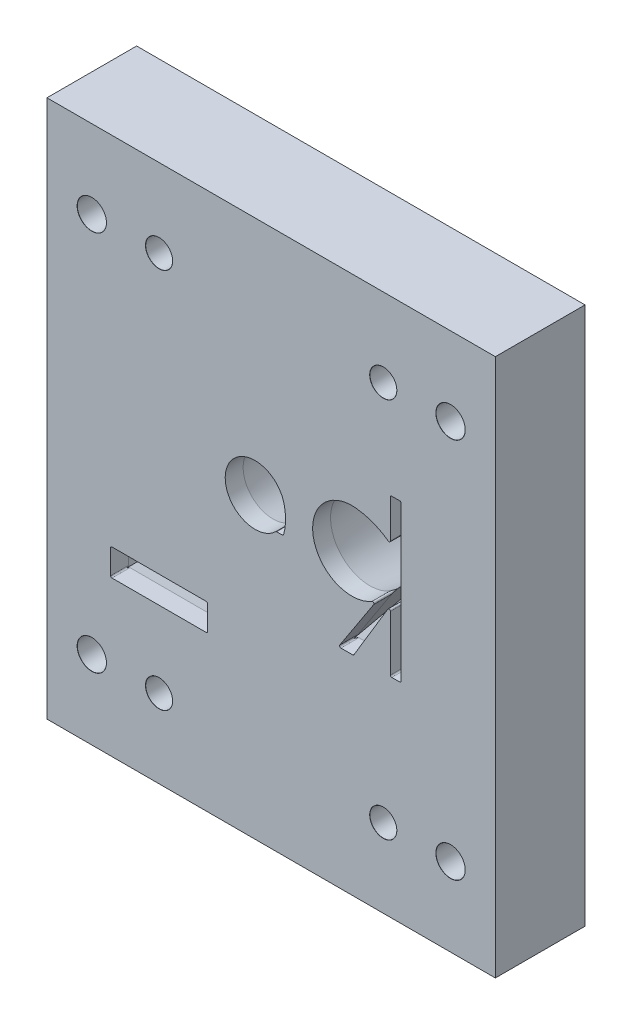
ISO-10303-21;
HEADER;
FILE_DESCRIPTION(('STEP AP214'),'2;1');
FILE_NAME('part.step','',(''),(''),'','','');
FILE_SCHEMA(('AUTOMOTIVE_DESIGN { 1 0 10303 214 1 1 1 1 }'));
ENDSEC;
DATA;
#1=APPLICATION_CONTEXT('core data for automotive mechanical design processes');
#2=APPLICATION_PROTOCOL_DEFINITION('international standard','automotive_design',2000,#1);
#3=PRODUCT_CONTEXT('',#1,'mechanical');
#4=PRODUCT('Part','Part','',(#3));
#5=PRODUCT_RELATED_PRODUCT_CATEGORY('part','',(#4));
#6=PRODUCT_DEFINITION_FORMATION('','',#4);
#7=PRODUCT_DEFINITION_CONTEXT('part definition',#1,'design');
#8=PRODUCT_DEFINITION('design','',#6,#7);
#9=PRODUCT_DEFINITION_SHAPE('','',#8);
#10=(LENGTH_UNIT() NAMED_UNIT(*) SI_UNIT(.MILLI.,.METRE.));
#11=(NAMED_UNIT(*) PLANE_ANGLE_UNIT() SI_UNIT($,.RADIAN.));
#12=(NAMED_UNIT(*) SI_UNIT($,.STERADIAN.) SOLID_ANGLE_UNIT());
#13=UNCERTAINTY_MEASURE_WITH_UNIT(LENGTH_MEASURE(1.E-05),#10,'distance_accuracy_value','');
#14=(GEOMETRIC_REPRESENTATION_CONTEXT(3) GLOBAL_UNCERTAINTY_ASSIGNED_CONTEXT((#13)) GLOBAL_UNIT_ASSIGNED_CONTEXT((#10,
#11,#12)) REPRESENTATION_CONTEXT('',''));
#15=CARTESIAN_POINT('',(0.,0.,0.));
#16=DIRECTION('',(0.,0.,1.));
#17=DIRECTION('',(1.,0.,0.));
#18=AXIS2_PLACEMENT_3D('',#15,#16,#17);
#19=CARTESIAN_POINT('',(50.,60.,20.));
#20=DIRECTION('',(-1.,0.,0.));
#21=DIRECTION('',(0.,-1.,0.));
#22=AXIS2_PLACEMENT_3D('',#19,#20,#21);
#23=PLANE('',#22);
#24=DIRECTION('',(0.,1.,0.));
#25=VECTOR('',#24,1.);
#26=CARTESIAN_POINT('',(50.,60.,0.));
#27=LINE('',#26,#25);
#28=CARTESIAN_POINT('',(50.,-60.,0.));
#29=VERTEX_POINT('',#28);
#30=CARTESIAN_POINT('',(50.,60.,0.));
#31=VERTEX_POINT('',#30);
#32=EDGE_CURVE('E755',#29,#31,#27,.T.);
#33=ORIENTED_EDGE('',*,*,#32,.T.);
#34=DIRECTION('',(0.,0.,-1.));
#35=VECTOR('',#34,1.);
#36=CARTESIAN_POINT('',(50.,60.,20.));
#37=LINE('',#36,#35);
#38=CARTESIAN_POINT('',(50.,60.,20.));
#39=VERTEX_POINT('',#38);
#40=EDGE_CURVE('E793',#39,#31,#37,.T.);
#41=ORIENTED_EDGE('',*,*,#40,.F.);
#42=DIRECTION('',(0.,1.,0.));
#43=VECTOR('',#42,1.);
#44=CARTESIAN_POINT('',(50.,60.,20.));
#45=LINE('',#44,#43);
#46=CARTESIAN_POINT('',(50.,-60.,20.));
#47=VERTEX_POINT('',#46);
#48=EDGE_CURVE('E756',#47,#39,#45,.T.);
#49=ORIENTED_EDGE('',*,*,#48,.F.);
#50=DIRECTION('',(0.,0.,-1.));
#51=VECTOR('',#50,1.);
#52=CARTESIAN_POINT('',(50.,-60.,20.));
#53=LINE('',#52,#51);
#54=EDGE_CURVE('E770',#47,#29,#53,.T.);
#55=ORIENTED_EDGE('',*,*,#54,.T.);
#56=EDGE_LOOP('',(#33,#41,#49,#55));
#57=FACE_BOUND('',#56,.T.);
#58=ADVANCED_FACE('F38',(#57),#23,.F.);
#59=CARTESIAN_POINT('',(-50.,60.,20.));
#60=DIRECTION('',(0.,-1.,0.));
#61=DIRECTION('',(0.,0.,-1.));
#62=AXIS2_PLACEMENT_3D('',#59,#60,#61);
#63=PLANE('',#62);
#64=DIRECTION('',(-1.,0.,0.));
#65=VECTOR('',#64,1.);
#66=CARTESIAN_POINT('',(-50.,60.,0.));
#67=LINE('',#66,#65);
#68=CARTESIAN_POINT('',(-50.,60.,0.));
#69=VERTEX_POINT('',#68);
#70=EDGE_CURVE('E774',#31,#69,#67,.T.);
#71=ORIENTED_EDGE('',*,*,#70,.T.);
#72=DIRECTION('',(0.,0.,-1.));
#73=VECTOR('',#72,1.);
#74=CARTESIAN_POINT('',(-50.,60.,20.));
#75=LINE('',#74,#73);
#76=CARTESIAN_POINT('',(-50.,60.,20.));
#77=VERTEX_POINT('',#76);
#78=EDGE_CURVE('E789',#77,#69,#75,.T.);
#79=ORIENTED_EDGE('',*,*,#78,.F.);
#80=DIRECTION('',(-1.,0.,0.));
#81=VECTOR('',#80,1.);
#82=CARTESIAN_POINT('',(-50.,60.,20.));
#83=LINE('',#82,#81);
#84=EDGE_CURVE('E760',#39,#77,#83,.T.);
#85=ORIENTED_EDGE('',*,*,#84,.F.);
#86=ORIENTED_EDGE('',*,*,#40,.T.);
#87=EDGE_LOOP('',(#71,#79,#85,#86));
#88=FACE_BOUND('',#87,.T.);
#89=ADVANCED_FACE('F1051',(#88),#63,.F.);
#90=CARTESIAN_POINT('',(-50.,60.,20.));
#91=DIRECTION('',(1.,0.,0.));
#92=DIRECTION('',(0.,1.,0.));
#93=AXIS2_PLACEMENT_3D('',#90,#91,#92);
#94=PLANE('',#93);
#95=DIRECTION('',(0.,-1.,0.));
#96=VECTOR('',#95,1.);
#97=CARTESIAN_POINT('',(-50.,60.,0.));
#98=LINE('',#97,#96);
#99=CARTESIAN_POINT('',(-50.,-60.,0.));
#100=VERTEX_POINT('',#99);
#101=EDGE_CURVE('E777',#69,#100,#98,.T.);
#102=ORIENTED_EDGE('',*,*,#101,.T.);
#103=DIRECTION('',(0.,0.,-1.));
#104=VECTOR('',#103,1.);
#105=CARTESIAN_POINT('',(-50.,-60.,20.));
#106=LINE('',#105,#104);
#107=CARTESIAN_POINT('',(-50.,-60.,20.));
#108=VERTEX_POINT('',#107);
#109=EDGE_CURVE('E785',#108,#100,#106,.T.);
#110=ORIENTED_EDGE('',*,*,#109,.F.);
#111=DIRECTION('',(0.,-1.,0.));
#112=VECTOR('',#111,1.);
#113=CARTESIAN_POINT('',(-50.,60.,20.));
#114=LINE('',#113,#112);
#115=EDGE_CURVE('E764',#77,#108,#114,.T.);
#116=ORIENTED_EDGE('',*,*,#115,.F.);
#117=ORIENTED_EDGE('',*,*,#78,.T.);
#118=EDGE_LOOP('',(#102,#110,#116,#117));
#119=FACE_BOUND('',#118,.T.);
#120=ADVANCED_FACE('F1057',(#119),#94,.F.);
#121=CARTESIAN_POINT('',(-50.,-60.,20.));
#122=DIRECTION('',(0.,1.,0.));
#123=DIRECTION('',(0.,0.,1.));
#124=AXIS2_PLACEMENT_3D('',#121,#122,#123);
#125=PLANE('',#124);
#126=DIRECTION('',(1.,0.,0.));
#127=VECTOR('',#126,1.);
#128=CARTESIAN_POINT('',(-50.,-60.,0.));
#129=LINE('',#128,#127);
#130=EDGE_CURVE('E761',#100,#29,#129,.T.);
#131=ORIENTED_EDGE('',*,*,#130,.T.);
#132=ORIENTED_EDGE('',*,*,#54,.F.);
#133=DIRECTION('',(1.,0.,0.));
#134=VECTOR('',#133,1.);
#135=CARTESIAN_POINT('',(-50.,-60.,20.));
#136=LINE('',#135,#134);
#137=EDGE_CURVE('E767',#108,#47,#136,.T.);
#138=ORIENTED_EDGE('',*,*,#137,.F.);
#139=ORIENTED_EDGE('',*,*,#109,.T.);
#140=EDGE_LOOP('',(#131,#132,#138,#139));
#141=FACE_BOUND('',#140,.T.);
#142=ADVANCED_FACE('F1765',(#141),#125,.F.);
#143=CARTESIAN_POINT('',(0.,0.,20.));
#144=DIRECTION('',(0.,0.,1.));
#145=DIRECTION('',(1.,0.,0.));
#146=AXIS2_PLACEMENT_3D('',#143,#144,#145);
#147=PLANE('',#146);
#148=DIRECTION('',(0.,-1.,0.));
#149=VECTOR('',#148,1.);
#150=CARTESIAN_POINT('',(-35.8,-19.5,20.));
#151=LINE('',#150,#149);
#152=CARTESIAN_POINT('',(-35.8,-19.8,20.));
#153=VERTEX_POINT('',#152);
#154=CARTESIAN_POINT('',(-35.8,-25.2,20.));
#155=VERTEX_POINT('',#154);
#156=EDGE_CURVE('E539',#153,#155,#151,.T.);
#157=ORIENTED_EDGE('',*,*,#156,.F.);
#158=CARTESIAN_POINT('',(-35.5,-19.8,20.));
#159=DIRECTION('',(0.,0.,1.));
#160=DIRECTION('',(1.,0.,0.));
#161=AXIS2_PLACEMENT_3D('',#158,#159,#160);
#162=CIRCLE('',#161,0.3);
#163=CARTESIAN_POINT('',(-35.5,-19.5,20.));
#164=VERTEX_POINT('',#163);
#165=EDGE_CURVE('E492',#153,#164,#162,.F.);
#166=ORIENTED_EDGE('',*,*,#165,.T.);
#167=DIRECTION('',(-1.,0.,0.));
#168=VECTOR('',#167,1.);
#169=CARTESIAN_POINT('',(-35.8,-19.5,20.));
#170=LINE('',#169,#168);
#171=CARTESIAN_POINT('',(-14.5,-19.5,20.));
#172=VERTEX_POINT('',#171);
#173=EDGE_CURVE('E532',#172,#164,#170,.T.);
#174=ORIENTED_EDGE('',*,*,#173,.F.);
#175=CARTESIAN_POINT('',(-14.5,-19.8,20.));
#176=DIRECTION('',(0.,0.,1.));
#177=DIRECTION('',(1.,0.,0.));
#178=AXIS2_PLACEMENT_3D('',#175,#176,#177);
#179=CIRCLE('',#178,0.3);
#180=CARTESIAN_POINT('',(-14.2,-19.8,20.));
#181=VERTEX_POINT('',#180);
#182=EDGE_CURVE('E482',#172,#181,#179,.F.);
#183=ORIENTED_EDGE('',*,*,#182,.T.);
#184=DIRECTION('',(0.,1.,0.));
#185=VECTOR('',#184,1.);
#186=CARTESIAN_POINT('',(-14.2,-19.5,20.));
#187=LINE('',#186,#185);
#188=CARTESIAN_POINT('',(-14.2,-25.2,20.));
#189=VERTEX_POINT('',#188);
#190=EDGE_CURVE('E547',#189,#181,#187,.T.);
#191=ORIENTED_EDGE('',*,*,#190,.F.);
#192=CARTESIAN_POINT('',(-14.5,-25.2,20.));
#193=DIRECTION('',(0.,0.,1.));
#194=DIRECTION('',(1.,0.,0.));
#195=AXIS2_PLACEMENT_3D('',#192,#193,#194);
#196=CIRCLE('',#195,0.3);
#197=CARTESIAN_POINT('',(-14.5,-25.5,20.));
#198=VERTEX_POINT('',#197);
#199=EDGE_CURVE('E470',#189,#198,#196,.F.);
#200=ORIENTED_EDGE('',*,*,#199,.T.);
#201=DIRECTION('',(1.,0.,0.));
#202=VECTOR('',#201,1.);
#203=CARTESIAN_POINT('',(-35.8,-25.5,20.));
#204=LINE('',#203,#202);
#205=CARTESIAN_POINT('',(-35.5,-25.5,20.));
#206=VERTEX_POINT('',#205);
#207=EDGE_CURVE('E543',#206,#198,#204,.T.);
#208=ORIENTED_EDGE('',*,*,#207,.F.);
#209=CARTESIAN_POINT('',(-35.5,-25.2,20.));
#210=DIRECTION('',(0.,0.,1.));
#211=DIRECTION('',(1.,0.,0.));
#212=AXIS2_PLACEMENT_3D('',#209,#210,#211);
#213=CIRCLE('',#212,0.3);
#214=EDGE_CURVE('E500',#206,#155,#213,.F.);
#215=ORIENTED_EDGE('',*,*,#214,.T.);
#216=EDGE_LOOP('',(#157,#166,#174,#183,#191,#200,#208,#215));
#217=FACE_BOUND('',#216,.T.);
#218=CARTESIAN_POINT('',(17.3614039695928,0.282709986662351,20.));
#219=DIRECTION('',(0.,0.,1.));
#220=DIRECTION('',(1.,0.,0.));
#221=AXIS2_PLACEMENT_3D('',#218,#219,#220);
#222=CIRCLE('',#221,15.);
#223=CARTESIAN_POINT('',(26.1247334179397,12.45661884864,20.));
#224=VERTEX_POINT('',#223);
#225=CARTESIAN_POINT('',(18.89403444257,15.2042060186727,20.));
#226=VERTEX_POINT('',#225);
#227=EDGE_CURVE('E598',#224,#226,#222,.T.);
#228=ORIENTED_EDGE('',*,*,#227,.F.);
#229=CARTESIAN_POINT('',(26.3000000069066,12.7000970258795,20.));
#230=DIRECTION('',(0.,0.,1.));
#231=DIRECTION('',(1.,0.,0.));
#232=AXIS2_PLACEMENT_3D('',#229,#230,#231);
#233=CIRCLE('',#232,0.3);
#234=CARTESIAN_POINT('',(26.6000000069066,12.7000970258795,20.));
#235=VERTEX_POINT('',#234);
#236=EDGE_CURVE('E831',#224,#235,#233,.T.);
#237=ORIENTED_EDGE('',*,*,#236,.T.);
#238=DIRECTION('',(0.,-1.,0.));
#239=VECTOR('',#238,1.);
#240=CARTESIAN_POINT('',(26.6000000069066,21.5,20.));
#241=LINE('',#240,#239);
#242=CARTESIAN_POINT('',(26.6000000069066,21.2,20.));
#243=VERTEX_POINT('',#242);
#244=EDGE_CURVE('E594',#243,#235,#241,.T.);
#245=ORIENTED_EDGE('',*,*,#244,.F.);
#246=CARTESIAN_POINT('',(26.9000000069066,21.2,20.));
#247=DIRECTION('',(0.,0.,1.));
#248=DIRECTION('',(1.,0.,0.));
#249=AXIS2_PLACEMENT_3D('',#246,#247,#248);
#250=CIRCLE('',#249,0.3);
#251=CARTESIAN_POINT('',(26.9000000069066,21.5,20.));
#252=VERTEX_POINT('',#251);
#253=EDGE_CURVE('E973',#243,#252,#250,.F.);
#254=ORIENTED_EDGE('',*,*,#253,.T.);
#255=DIRECTION('',(-1.,0.,0.));
#256=VECTOR('',#255,1.);
#257=CARTESIAN_POINT('',(26.6000000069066,21.5,20.));
#258=LINE('',#257,#256);
#259=CARTESIAN_POINT('',(28.7,21.5,20.));
#260=VERTEX_POINT('',#259);
#261=EDGE_CURVE('E559',#260,#252,#258,.T.);
#262=ORIENTED_EDGE('',*,*,#261,.F.);
#263=CARTESIAN_POINT('',(28.7,21.2,20.));
#264=DIRECTION('',(0.,0.,1.));
#265=DIRECTION('',(1.,0.,0.));
#266=AXIS2_PLACEMENT_3D('',#263,#264,#265);
#267=CIRCLE('',#266,0.3);
#268=CARTESIAN_POINT('',(29.,21.2,20.));
#269=VERTEX_POINT('',#268);
#270=EDGE_CURVE('E963',#260,#269,#267,.F.);
#271=ORIENTED_EDGE('',*,*,#270,.T.);
#272=DIRECTION('',(0.,1.,0.));
#273=VECTOR('',#272,1.);
#274=CARTESIAN_POINT('',(29.,21.5,20.));
#275=LINE('',#274,#273);
#276=CARTESIAN_POINT('',(29.,-13.2,20.));
#277=VERTEX_POINT('',#276);
#278=EDGE_CURVE('E626',#277,#269,#275,.T.);
#279=ORIENTED_EDGE('',*,*,#278,.F.);
#280=CARTESIAN_POINT('',(28.7,-13.2,20.));
#281=DIRECTION('',(0.,0.,1.));
#282=DIRECTION('',(1.,0.,0.));
#283=AXIS2_PLACEMENT_3D('',#280,#281,#282);
#284=CIRCLE('',#283,0.3);
#285=CARTESIAN_POINT('',(28.7,-13.5,20.));
#286=VERTEX_POINT('',#285);
#287=EDGE_CURVE('E983',#277,#286,#284,.F.);
#288=ORIENTED_EDGE('',*,*,#287,.T.);
#289=DIRECTION('',(1.,0.,0.));
#290=VECTOR('',#289,1.);
#291=CARTESIAN_POINT('',(26.6000000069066,-13.5,20.));
#292=LINE('',#291,#290);
#293=CARTESIAN_POINT('',(26.9000000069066,-13.5,20.));
#294=VERTEX_POINT('',#293);
#295=EDGE_CURVE('E622',#294,#286,#292,.T.);
#296=ORIENTED_EDGE('',*,*,#295,.F.);
#297=CARTESIAN_POINT('',(26.9000000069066,-13.2,20.));
#298=DIRECTION('',(0.,0.,1.));
#299=DIRECTION('',(1.,0.,0.));
#300=AXIS2_PLACEMENT_3D('',#297,#298,#299);
#301=CIRCLE('',#300,0.3);
#302=CARTESIAN_POINT('',(26.6000000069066,-13.2,20.));
#303=VERTEX_POINT('',#302);
#304=EDGE_CURVE('E993',#294,#303,#301,.F.);
#305=ORIENTED_EDGE('',*,*,#304,.T.);
#306=DIRECTION('',(0.,-1.,0.));
#307=VECTOR('',#306,1.);
#308=CARTESIAN_POINT('',(26.6000000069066,0.200000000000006,20.));
#309=LINE('',#308,#307);
#310=CARTESIAN_POINT('',(26.6000000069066,-0.880841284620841,20.));
#311=VERTEX_POINT('',#310);
#312=EDGE_CURVE('E618',#311,#303,#309,.T.);
#313=ORIENTED_EDGE('',*,*,#312,.F.);
#314=CARTESIAN_POINT('',(26.3000000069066,-0.880841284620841,20.));
#315=DIRECTION('',(0.,0.,1.));
#316=DIRECTION('',(1.,0.,0.));
#317=AXIS2_PLACEMENT_3D('',#314,#315,#316);
#318=CIRCLE('',#317,0.3);
#319=CARTESIAN_POINT('',(26.0429178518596,-0.72621668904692,20.));
#320=VERTEX_POINT('',#319);
#321=EDGE_CURVE('E828',#311,#320,#318,.T.);
#322=ORIENTED_EDGE('',*,*,#321,.T.);
#323=DIRECTION('',(0.515415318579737,0.856940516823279,0.));
#324=VECTOR('',#323,1.);
#325=CARTESIAN_POINT('',(26.6000000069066,0.200000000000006,20.));
#326=LINE('',#325,#324);
#327=CARTESIAN_POINT('',(18.4474374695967,-13.3546245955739,20.));
#328=VERTEX_POINT('',#327);
#329=EDGE_CURVE('E614',#328,#320,#326,.T.);
#330=ORIENTED_EDGE('',*,*,#329,.F.);
#331=CARTESIAN_POINT('',(18.1903553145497,-13.2,20.));
#332=DIRECTION('',(0.,0.,1.));
#333=DIRECTION('',(1.,0.,0.));
#334=AXIS2_PLACEMENT_3D('',#331,#332,#333);
#335=CIRCLE('',#334,0.3);
#336=CARTESIAN_POINT('',(18.1903553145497,-13.5,20.));
#337=VERTEX_POINT('',#336);
#338=EDGE_CURVE('E1013',#328,#337,#335,.F.);
#339=ORIENTED_EDGE('',*,*,#338,.T.);
#340=DIRECTION('',(1.,0.,0.));
#341=VECTOR('',#340,1.);
#342=CARTESIAN_POINT('',(15.,-13.5,20.));
#343=LINE('',#342,#341);
#344=CARTESIAN_POINT('',(15.5540094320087,-13.5,20.));
#345=VERTEX_POINT('',#344);
#346=EDGE_CURVE('E610',#345,#337,#343,.T.);
#347=ORIENTED_EDGE('',*,*,#346,.F.);
#348=CARTESIAN_POINT('',(15.5540094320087,-13.2,20.));
#349=DIRECTION('',(0.,0.,1.));
#350=DIRECTION('',(1.,0.,0.));
#351=AXIS2_PLACEMENT_3D('',#348,#349,#350);
#352=CIRCLE('',#351,0.3);
#353=CARTESIAN_POINT('',(15.3027747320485,-13.0360453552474,20.));
#354=VERTEX_POINT('',#353);
#355=EDGE_CURVE('E1003',#345,#354,#352,.F.);
#356=ORIENTED_EDGE('',*,*,#355,.T.);
#357=DIRECTION('',(-0.546515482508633,-0.837448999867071,0.));
#358=VECTOR('',#357,1.);
#359=CARTESIAN_POINT('',(23.744780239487,-0.0999999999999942,20.));
#360=LINE('',#359,#358);
#361=CARTESIAN_POINT('',(22.8634716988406,-1.45046669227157,20.));
#362=VERTEX_POINT('',#361);
#363=EDGE_CURVE('E606',#362,#354,#360,.T.);
#364=ORIENTED_EDGE('',*,*,#363,.F.);
#365=CARTESIAN_POINT('',(22.6122369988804,-1.28651204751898,20.));
#366=DIRECTION('',(0.,0.,1.));
#367=DIRECTION('',(1.,0.,0.));
#368=AXIS2_PLACEMENT_3D('',#365,#366,#367);
#369=CIRCLE('',#368,0.3);
#370=CARTESIAN_POINT('',(22.4593451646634,-1.02839562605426,20.));
#371=VERTEX_POINT('',#370);
#372=EDGE_CURVE('E825',#362,#371,#369,.T.);
#373=ORIENTED_EDGE('',*,*,#372,.T.);
#374=CARTESIAN_POINT('',(18.,6.50000000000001,20.));
#375=DIRECTION('',(0.,0.,1.));
#376=DIRECTION('',(1.,0.,0.));
#377=AXIS2_PLACEMENT_3D('',#374,#375,#376);
#378=CIRCLE('',#377,8.75000000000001);
#379=EDGE_CURVE('E602',#226,#371,#378,.T.);
#380=ORIENTED_EDGE('',*,*,#379,.F.);
#381=EDGE_LOOP('',(#228,#237,#245,#254,#262,#271,#279,#288,#296,#305,#313,#322,#330,#339,#347,
#356,#364,#373,#380));
#382=FACE_BOUND('',#381,.T.);
#383=DIRECTION('',(1.,0.,0.));
#384=VECTOR('',#383,1.);
#385=CARTESIAN_POINT('',(1.09999999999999,1.79548089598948,20.));
#386=LINE('',#385,#384);
#387=CARTESIAN_POINT('',(1.22258110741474,1.79548089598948,20.));
#388=VERTEX_POINT('',#387);
#389=CARTESIAN_POINT('',(2.47649703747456,1.79548089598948,20.));
#390=VERTEX_POINT('',#389);
#391=EDGE_CURVE('E651',#388,#390,#386,.T.);
#392=ORIENTED_EDGE('',*,*,#391,.F.);
#393=CARTESIAN_POINT('',(1.22258110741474,1.49548089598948,20.));
#394=DIRECTION('',(0.,0.,1.));
#395=DIRECTION('',(1.,0.,0.));
#396=AXIS2_PLACEMENT_3D('',#393,#394,#395);
#397=CIRCLE('',#396,0.3);
#398=CARTESIAN_POINT('',(1.01441213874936,1.71150330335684,20.));
#399=VERTEX_POINT('',#398);
#400=EDGE_CURVE('E822',#388,#399,#397,.T.);
#401=ORIENTED_EDGE('',*,*,#400,.T.);
#402=CARTESIAN_POINT('',(-3.60000000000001,6.50000000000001,20.));
#403=DIRECTION('',(0.,0.,1.));
#404=DIRECTION('',(1.,0.,0.));
#405=AXIS2_PLACEMENT_3D('',#402,#403,#404);
#406=CIRCLE('',#405,6.65);
#407=CARTESIAN_POINT('',(2.82466212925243,8.21645463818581,20.));
#408=VERTEX_POINT('',#407);
#409=EDGE_CURVE('E375',#408,#399,#406,.T.);
#410=ORIENTED_EDGE('',*,*,#409,.F.);
#411=CARTESIAN_POINT('',(-8.38226729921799,5.22233827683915,20.));
#412=DIRECTION('',(0.,0.,1.));
#413=DIRECTION('',(1.,0.,0.));
#414=AXIS2_PLACEMENT_3D('',#411,#412,#413);
#415=CIRCLE('',#414,11.6);
#416=CARTESIAN_POINT('',(2.7647828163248,2.01246698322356,20.));
#417=VERTEX_POINT('',#416);
#418=EDGE_CURVE('E641',#417,#408,#415,.T.);
#419=ORIENTED_EDGE('',*,*,#418,.F.);
#420=CARTESIAN_POINT('',(2.47649703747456,2.09548089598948,20.));
#421=DIRECTION('',(0.,0.,1.));
#422=DIRECTION('',(1.,0.,0.));
#423=AXIS2_PLACEMENT_3D('',#420,#421,#422);
#424=CIRCLE('',#423,0.3);
#425=EDGE_CURVE('E1022',#417,#390,#424,.F.);
#426=ORIENTED_EDGE('',*,*,#425,.T.);
#427=EDGE_LOOP('',(#392,#401,#410,#419,#426));
#428=FACE_BOUND('',#427,.T.);
#429=CARTESIAN_POINT('',(-25.,42.5,20.));
#430=DIRECTION('',(0.,0.,1.));
#431=DIRECTION('',(1.,0.,0.));
#432=AXIS2_PLACEMENT_3D('',#429,#430,#431);
#433=CIRCLE('',#432,3.025);
#434=CARTESIAN_POINT('',(-21.975,42.5,20.));
#435=VERTEX_POINT('',#434);
#436=EDGE_CURVE('E538',#435,#435,#433,.T.);
#437=ORIENTED_EDGE('',*,*,#436,.F.);
#438=EDGE_LOOP('',(#437));
#439=FACE_BOUND('',#438,.T.);
#440=CARTESIAN_POINT('',(25.,42.5,20.));
#441=DIRECTION('',(0.,0.,1.));
#442=DIRECTION('',(1.,0.,0.));
#443=AXIS2_PLACEMENT_3D('',#440,#441,#442);
#444=CIRCLE('',#443,3.025);
#445=CARTESIAN_POINT('',(28.025,42.5,20.));
#446=VERTEX_POINT('',#445);
#447=EDGE_CURVE('E671',#446,#446,#444,.T.);
#448=ORIENTED_EDGE('',*,*,#447,.F.);
#449=EDGE_LOOP('',(#448));
#450=FACE_BOUND('',#449,.T.);
#451=CARTESIAN_POINT('',(25.,-42.5,20.));
#452=DIRECTION('',(0.,0.,1.));
#453=DIRECTION('',(1.,0.,0.));
#454=AXIS2_PLACEMENT_3D('',#451,#452,#453);
#455=CIRCLE('',#454,3.025);
#456=CARTESIAN_POINT('',(28.025,-42.5,20.));
#457=VERTEX_POINT('',#456);
#458=EDGE_CURVE('E683',#457,#457,#455,.T.);
#459=ORIENTED_EDGE('',*,*,#458,.F.);
#460=EDGE_LOOP('',(#459));
#461=FACE_BOUND('',#460,.T.);
#462=CARTESIAN_POINT('',(-25.,-42.5,20.));
#463=DIRECTION('',(0.,0.,1.));
#464=DIRECTION('',(1.,0.,0.));
#465=AXIS2_PLACEMENT_3D('',#462,#463,#464);
#466=CIRCLE('',#465,3.025);
#467=CARTESIAN_POINT('',(-21.975,-42.5,20.));
#468=VERTEX_POINT('',#467);
#469=EDGE_CURVE('E695',#468,#468,#466,.T.);
#470=ORIENTED_EDGE('',*,*,#469,.F.);
#471=EDGE_LOOP('',(#470));
#472=FACE_BOUND('',#471,.T.);
#473=CARTESIAN_POINT('',(-40.,42.5,20.));
#474=DIRECTION('',(0.,0.,1.));
#475=DIRECTION('',(1.,0.,0.));
#476=AXIS2_PLACEMENT_3D('',#473,#474,#475);
#477=CIRCLE('',#476,3.275);
#478=CARTESIAN_POINT('',(-36.725,42.5,20.));
#479=VERTEX_POINT('',#478);
#480=EDGE_CURVE('E707',#479,#479,#477,.T.);
#481=ORIENTED_EDGE('',*,*,#480,.F.);
#482=EDGE_LOOP('',(#481));
#483=FACE_BOUND('',#482,.T.);
#484=CARTESIAN_POINT('',(40.,42.5,20.));
#485=DIRECTION('',(0.,0.,1.));
#486=DIRECTION('',(1.,0.,0.));
#487=AXIS2_PLACEMENT_3D('',#484,#485,#486);
#488=CIRCLE('',#487,3.275);
#489=CARTESIAN_POINT('',(43.275,42.5,20.));
#490=VERTEX_POINT('',#489);
#491=EDGE_CURVE('E719',#490,#490,#488,.T.);
#492=ORIENTED_EDGE('',*,*,#491,.F.);
#493=EDGE_LOOP('',(#492));
#494=FACE_BOUND('',#493,.T.);
#495=CARTESIAN_POINT('',(40.,-42.5,20.));
#496=DIRECTION('',(0.,0.,1.));
#497=DIRECTION('',(1.,0.,0.));
#498=AXIS2_PLACEMENT_3D('',#495,#496,#497);
#499=CIRCLE('',#498,3.275);
#500=CARTESIAN_POINT('',(43.275,-42.5,20.));
#501=VERTEX_POINT('',#500);
#502=EDGE_CURVE('E731',#501,#501,#499,.T.);
#503=ORIENTED_EDGE('',*,*,#502,.F.);
#504=EDGE_LOOP('',(#503));
#505=FACE_BOUND('',#504,.T.);
#506=CARTESIAN_POINT('',(-40.,-42.5,20.));
#507=DIRECTION('',(0.,0.,1.));
#508=DIRECTION('',(1.,0.,0.));
#509=AXIS2_PLACEMENT_3D('',#506,#507,#508);
#510=CIRCLE('',#509,3.275);
#511=CARTESIAN_POINT('',(-36.725,-42.5,20.));
#512=VERTEX_POINT('',#511);
#513=EDGE_CURVE('E743',#512,#512,#510,.T.);
#514=ORIENTED_EDGE('',*,*,#513,.F.);
#515=EDGE_LOOP('',(#514));
#516=FACE_BOUND('',#515,.T.);
#517=ORIENTED_EDGE('',*,*,#48,.T.);
#518=ORIENTED_EDGE('',*,*,#84,.T.);
#519=ORIENTED_EDGE('',*,*,#115,.T.);
#520=ORIENTED_EDGE('',*,*,#137,.T.);
#521=EDGE_LOOP('',(#517,#518,#519,#520));
#522=FACE_BOUND('',#521,.T.);
#523=ADVANCED_FACE('F1035',(#217,#382,#428,#439,#450,#461,#472,#483,#494,#505,#516,#522),#147,.T.);
#524=CARTESIAN_POINT('',(0.,0.,0.));
#525=DIRECTION('',(0.,0.,1.));
#526=DIRECTION('',(1.,0.,0.));
#527=AXIS2_PLACEMENT_3D('',#524,#525,#526);
#528=PLANE('',#527);
#529=DIRECTION('',(-1.,0.,0.));
#530=VECTOR('',#529,1.);
#531=CARTESIAN_POINT('',(0.,-16.6787683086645,0.));
#532=LINE('',#531,#530);
#533=CARTESIAN_POINT('',(-11.3787683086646,-16.6787683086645,0.));
#534=VERTEX_POINT('',#533);
#535=CARTESIAN_POINT('',(-38.6212316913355,-16.6787683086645,0.));
#536=VERTEX_POINT('',#535);
#537=EDGE_CURVE('E368',#534,#536,#532,.T.);
#538=ORIENTED_EDGE('',*,*,#537,.T.);
#539=DIRECTION('',(0.,-1.,0.));
#540=VECTOR('',#539,1.);
#541=CARTESIAN_POINT('',(-38.6212316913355,0.,0.));
#542=LINE('',#541,#540);
#543=CARTESIAN_POINT('',(-38.6212316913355,-28.3212316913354,0.));
#544=VERTEX_POINT('',#543);
#545=EDGE_CURVE('E379',#536,#544,#542,.T.);
#546=ORIENTED_EDGE('',*,*,#545,.T.);
#547=DIRECTION('',(1.,0.,0.));
#548=VECTOR('',#547,1.);
#549=CARTESIAN_POINT('',(0.,-28.3212316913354,0.));
#550=LINE('',#549,#548);
#551=CARTESIAN_POINT('',(-11.3787683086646,-28.3212316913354,0.));
#552=VERTEX_POINT('',#551);
#553=EDGE_CURVE('E384',#544,#552,#550,.T.);
#554=ORIENTED_EDGE('',*,*,#553,.T.);
#555=DIRECTION('',(0.,1.,0.));
#556=VECTOR('',#555,1.);
#557=CARTESIAN_POINT('',(-11.3787683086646,0.,0.));
#558=LINE('',#557,#556);
#559=EDGE_CURVE('E389',#552,#534,#558,.T.);
#560=ORIENTED_EDGE('',*,*,#559,.T.);
#561=EDGE_LOOP('',(#538,#546,#554,#560));
#562=FACE_BOUND('',#561,.T.);
#563=CARTESIAN_POINT('',(-8.38226729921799,5.22233827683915,0.));
#564=DIRECTION('',(0.,0.,1.));
#565=DIRECTION('',(1.,0.,0.));
#566=AXIS2_PLACEMENT_3D('',#563,#564,#565);
#567=CIRCLE('',#566,14.4212316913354);
#568=CARTESIAN_POINT('',(4.61516731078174,-1.02575079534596,0.));
#569=VERTEX_POINT('',#568);
#570=CARTESIAN_POINT('',(5.55029527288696,8.94465256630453,0.));
#571=VERTEX_POINT('',#570);
#572=EDGE_CURVE('E412',#569,#571,#567,.T.);
#573=ORIENTED_EDGE('',*,*,#572,.T.);
#574=CARTESIAN_POINT('',(-3.60000000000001,6.50000000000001,0.));
#575=DIRECTION('',(0.,0.,1.));
#576=DIRECTION('',(1.,0.,0.));
#577=AXIS2_PLACEMENT_3D('',#574,#575,#576);
#578=CIRCLE('',#577,9.47123169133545);
#579=CARTESIAN_POINT('',(2.15041778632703,-1.02575079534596,0.));
#580=VERTEX_POINT('',#579);
#581=EDGE_CURVE('E870',#571,#580,#578,.T.);
#582=ORIENTED_EDGE('',*,*,#581,.T.);
#583=DIRECTION('',(1.,0.,0.));
#584=VECTOR('',#583,1.);
#585=CARTESIAN_POINT('',(-3.60000000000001,-1.02575079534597,0.));
#586=LINE('',#585,#584);
#587=EDGE_CURVE('E1936',#580,#569,#586,.T.);
#588=ORIENTED_EDGE('',*,*,#587,.T.);
#589=EDGE_LOOP('',(#573,#582,#588));
#590=FACE_BOUND('',#589,.T.);
#591=DIRECTION('',(0.,-1.,0.));
#592=VECTOR('',#591,1.);
#593=CARTESIAN_POINT('',(23.7787683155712,0.282709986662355,0.));
#594=LINE('',#593,#592);
#595=CARTESIAN_POINT('',(23.7787683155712,24.3212316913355,0.));
#596=VERTEX_POINT('',#595);
#597=CARTESIAN_POINT('',(23.7787683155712,16.9084049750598,0.));
#598=VERTEX_POINT('',#597);
#599=EDGE_CURVE('E1198',#596,#598,#594,.T.);
#600=ORIENTED_EDGE('',*,*,#599,.T.);
#601=CARTESIAN_POINT('',(17.3614039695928,0.282709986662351,0.));
#602=DIRECTION('',(0.,0.,1.));
#603=DIRECTION('',(1.,0.,0.));
#604=AXIS2_PLACEMENT_3D('',#601,#602,#603);
#605=CIRCLE('',#604,17.8212316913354);
#606=CARTESIAN_POINT('',(19.1822948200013,18.010672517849,0.));
#607=VERTEX_POINT('',#606);
#608=EDGE_CURVE('E1194',#598,#607,#605,.T.);
#609=ORIENTED_EDGE('',*,*,#608,.T.);
#610=CARTESIAN_POINT('',(18.,6.50000000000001,0.));
#611=DIRECTION('',(0.,0.,1.));
#612=DIRECTION('',(1.,0.,0.));
#613=AXIS2_PLACEMENT_3D('',#610,#611,#612);
#614=CIRCLE('',#613,11.5712316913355);
#615=CARTESIAN_POINT('',(17.1520400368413,-5.04011987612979,0.));
#616=VERTEX_POINT('',#615);
#617=EDGE_CURVE('E1190',#607,#616,#614,.T.);
#618=ORIENTED_EDGE('',*,*,#617,.T.);
#619=DIRECTION('',(-0.546515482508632,-0.83744899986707,0.));
#620=VECTOR('',#619,1.);
#621=CARTESIAN_POINT('',(19.6507193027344,-1.2112869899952,0.));
#622=LINE('',#621,#620);
#623=CARTESIAN_POINT('',(9.79003677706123,-16.3212316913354,0.));
#624=VERTEX_POINT('',#623);
#625=EDGE_CURVE('E1174',#616,#624,#622,.T.);
#626=ORIENTED_EDGE('',*,*,#625,.T.);
#627=DIRECTION('',(1.,0.,0.));
#628=VECTOR('',#627,1.);
#629=CARTESIAN_POINT('',(17.3614039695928,-16.3212316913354,0.));
#630=LINE('',#629,#628);
#631=CARTESIAN_POINT('',(19.9553565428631,-16.3212316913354,0.));
#632=VERTEX_POINT('',#631);
#633=EDGE_CURVE('E1179',#624,#632,#630,.T.);
#634=ORIENTED_EDGE('',*,*,#633,.T.);
#635=DIRECTION('',(0.515415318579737,0.856940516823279,0.));
#636=VECTOR('',#635,1.);
#637=CARTESIAN_POINT('',(26.5998988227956,-5.27387378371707,0.));
#638=LINE('',#637,#636);
#639=CARTESIAN_POINT('',(23.7787683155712,-9.96434561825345,0.));
#640=VERTEX_POINT('',#639);
#641=EDGE_CURVE('E1184',#632,#640,#638,.T.);
#642=ORIENTED_EDGE('',*,*,#641,.T.);
#643=DIRECTION('',(0.,-1.,0.));
#644=VECTOR('',#643,1.);
#645=CARTESIAN_POINT('',(23.7787683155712,0.282709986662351,0.));
#646=LINE('',#645,#644);
#647=CARTESIAN_POINT('',(23.7787683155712,-16.3212316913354,0.));
#648=VERTEX_POINT('',#647);
#649=EDGE_CURVE('E1216',#640,#648,#646,.T.);
#650=ORIENTED_EDGE('',*,*,#649,.T.);
#651=DIRECTION('',(1.,0.,0.));
#652=VECTOR('',#651,1.);
#653=CARTESIAN_POINT('',(17.3614039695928,-16.3212316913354,0.));
#654=LINE('',#653,#652);
#655=CARTESIAN_POINT('',(31.8212316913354,-16.3212316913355,0.));
#656=VERTEX_POINT('',#655);
#657=EDGE_CURVE('E1212',#648,#656,#654,.T.);
#658=ORIENTED_EDGE('',*,*,#657,.T.);
#659=DIRECTION('',(0.,1.,0.));
#660=VECTOR('',#659,1.);
#661=CARTESIAN_POINT('',(31.8212316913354,0.282709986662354,0.));
#662=LINE('',#661,#660);
#663=CARTESIAN_POINT('',(31.8212316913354,24.3212316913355,0.));
#664=VERTEX_POINT('',#663);
#665=EDGE_CURVE('E1204',#656,#664,#662,.T.);
#666=ORIENTED_EDGE('',*,*,#665,.T.);
#667=DIRECTION('',(-1.,0.,0.));
#668=VECTOR('',#667,1.);
#669=CARTESIAN_POINT('',(17.3614039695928,24.3212316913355,0.));
#670=LINE('',#669,#668);
#671=EDGE_CURVE('E1200',#664,#596,#670,.T.);
#672=ORIENTED_EDGE('',*,*,#671,.T.);
#673=EDGE_LOOP('',(#600,#609,#618,#626,#634,#642,#650,#658,#666,#672));
#674=FACE_BOUND('',#673,.T.);
#675=CARTESIAN_POINT('',(-25.,42.5,0.));
#676=DIRECTION('',(0.,0.,1.));
#677=DIRECTION('',(1.,0.,0.));
#678=AXIS2_PLACEMENT_3D('',#675,#676,#677);
#679=CIRCLE('',#678,3.);
#680=CARTESIAN_POINT('',(-22.,42.5,0.));
#681=VERTEX_POINT('',#680);
#682=EDGE_CURVE('E667',#681,#681,#679,.T.);
#683=ORIENTED_EDGE('',*,*,#682,.T.);
#684=EDGE_LOOP('',(#683));
#685=FACE_BOUND('',#684,.T.);
#686=CARTESIAN_POINT('',(25.,42.5,0.));
#687=DIRECTION('',(0.,0.,1.));
#688=DIRECTION('',(1.,0.,0.));
#689=AXIS2_PLACEMENT_3D('',#686,#687,#688);
#690=CIRCLE('',#689,3.);
#691=CARTESIAN_POINT('',(28.,42.5,0.));
#692=VERTEX_POINT('',#691);
#693=EDGE_CURVE('E679',#692,#692,#690,.T.);
#694=ORIENTED_EDGE('',*,*,#693,.T.);
#695=EDGE_LOOP('',(#694));
#696=FACE_BOUND('',#695,.T.);
#697=CARTESIAN_POINT('',(25.,-42.5,0.));
#698=DIRECTION('',(0.,0.,1.));
#699=DIRECTION('',(1.,0.,0.));
#700=AXIS2_PLACEMENT_3D('',#697,#698,#699);
#701=CIRCLE('',#700,3.);
#702=CARTESIAN_POINT('',(28.,-42.5,0.));
#703=VERTEX_POINT('',#702);
#704=EDGE_CURVE('E691',#703,#703,#701,.T.);
#705=ORIENTED_EDGE('',*,*,#704,.T.);
#706=EDGE_LOOP('',(#705));
#707=FACE_BOUND('',#706,.T.);
#708=CARTESIAN_POINT('',(-25.,-42.5,0.));
#709=DIRECTION('',(0.,0.,1.));
#710=DIRECTION('',(1.,0.,0.));
#711=AXIS2_PLACEMENT_3D('',#708,#709,#710);
#712=CIRCLE('',#711,3.);
#713=CARTESIAN_POINT('',(-22.,-42.5,0.));
#714=VERTEX_POINT('',#713);
#715=EDGE_CURVE('E703',#714,#714,#712,.T.);
#716=ORIENTED_EDGE('',*,*,#715,.T.);
#717=EDGE_LOOP('',(#716));
#718=FACE_BOUND('',#717,.T.);
#719=CARTESIAN_POINT('',(-40.,42.5,0.));
#720=DIRECTION('',(0.,0.,1.));
#721=DIRECTION('',(1.,0.,0.));
#722=AXIS2_PLACEMENT_3D('',#719,#720,#721);
#723=CIRCLE('',#722,3.24999999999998);
#724=CARTESIAN_POINT('',(-36.75,42.5,0.));
#725=VERTEX_POINT('',#724);
#726=EDGE_CURVE('E715',#725,#725,#723,.T.);
#727=ORIENTED_EDGE('',*,*,#726,.T.);
#728=EDGE_LOOP('',(#727));
#729=FACE_BOUND('',#728,.T.);
#730=CARTESIAN_POINT('',(40.,42.5,0.));
#731=DIRECTION('',(0.,0.,1.));
#732=DIRECTION('',(1.,0.,0.));
#733=AXIS2_PLACEMENT_3D('',#730,#731,#732);
#734=CIRCLE('',#733,3.24999999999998);
#735=CARTESIAN_POINT('',(43.25,42.5,0.));
#736=VERTEX_POINT('',#735);
#737=EDGE_CURVE('E727',#736,#736,#734,.T.);
#738=ORIENTED_EDGE('',*,*,#737,.T.);
#739=EDGE_LOOP('',(#738));
#740=FACE_BOUND('',#739,.T.);
#741=CARTESIAN_POINT('',(40.,-42.5,0.));
#742=DIRECTION('',(0.,0.,1.));
#743=DIRECTION('',(1.,0.,0.));
#744=AXIS2_PLACEMENT_3D('',#741,#742,#743);
#745=CIRCLE('',#744,3.24999999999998);
#746=CARTESIAN_POINT('',(43.25,-42.5,0.));
#747=VERTEX_POINT('',#746);
#748=EDGE_CURVE('E739',#747,#747,#745,.T.);
#749=ORIENTED_EDGE('',*,*,#748,.T.);
#750=EDGE_LOOP('',(#749));
#751=FACE_BOUND('',#750,.T.);
#752=CARTESIAN_POINT('',(-40.,-42.5,0.));
#753=DIRECTION('',(0.,0.,1.));
#754=DIRECTION('',(1.,0.,0.));
#755=AXIS2_PLACEMENT_3D('',#752,#753,#754);
#756=CIRCLE('',#755,3.24999999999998);
#757=CARTESIAN_POINT('',(-36.75,-42.5,0.));
#758=VERTEX_POINT('',#757);
#759=EDGE_CURVE('E751',#758,#758,#756,.T.);
#760=ORIENTED_EDGE('',*,*,#759,.T.);
#761=EDGE_LOOP('',(#760));
#762=FACE_BOUND('',#761,.T.);
#763=ORIENTED_EDGE('',*,*,#32,.F.);
#764=ORIENTED_EDGE('',*,*,#130,.F.);
#765=ORIENTED_EDGE('',*,*,#101,.F.);
#766=ORIENTED_EDGE('',*,*,#70,.F.);
#767=EDGE_LOOP('',(#763,#764,#765,#766));
#768=FACE_BOUND('',#767,.T.);
#769=ADVANCED_FACE('F387',(#562,#590,#674,#685,#696,#707,#718,#729,#740,#751,#762,#768),#528,.F.);
#770=CARTESIAN_POINT('',(-40.,-42.5,20.));
#771=DIRECTION('',(0.,0.,1.));
#772=DIRECTION('',(1.,0.,0.));
#773=AXIS2_PLACEMENT_3D('',#770,#771,#772);
#774=CYLINDRICAL_SURFACE('',#773,3.24999999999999);
#775=ORIENTED_EDGE('',*,*,#759,.F.);
#776=EDGE_LOOP('',(#775));
#777=FACE_BOUND('',#776,.T.);
#778=CARTESIAN_POINT('',(-40.,-42.5,19.975));
#779=DIRECTION('',(0.,0.,1.));
#780=DIRECTION('',(1.,0.,0.));
#781=AXIS2_PLACEMENT_3D('',#778,#779,#780);
#782=CIRCLE('',#781,3.25);
#783=CARTESIAN_POINT('',(-36.75,-42.5,19.975));
#784=VERTEX_POINT('',#783);
#785=EDGE_CURVE('E747',#784,#784,#782,.T.);
#786=ORIENTED_EDGE('',*,*,#785,.T.);
#787=EDGE_LOOP('',(#786));
#788=FACE_BOUND('',#787,.T.);
#789=ADVANCED_FACE('F1742',(#777,#788),#774,.F.);
#790=CARTESIAN_POINT('',(-40.,-42.5,20.));
#791=DIRECTION('',(0.,0.,1.));
#792=DIRECTION('',(1.,0.,0.));
#793=AXIS2_PLACEMENT_3D('',#790,#791,#792);
#794=CONICAL_SURFACE('',#793,3.275,0.785398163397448);
#795=ORIENTED_EDGE('',*,*,#785,.F.);
#796=EDGE_LOOP('',(#795));
#797=FACE_BOUND('',#796,.T.);
#798=ORIENTED_EDGE('',*,*,#513,.T.);
#799=EDGE_LOOP('',(#798));
#800=FACE_BOUND('',#799,.T.);
#801=ADVANCED_FACE('F1733',(#797,#800),#794,.F.);
#802=CARTESIAN_POINT('',(40.,-42.5,20.));
#803=DIRECTION('',(0.,0.,1.));
#804=DIRECTION('',(1.,0.,0.));
#805=AXIS2_PLACEMENT_3D('',#802,#803,#804);
#806=CYLINDRICAL_SURFACE('',#805,3.24999999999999);
#807=ORIENTED_EDGE('',*,*,#748,.F.);
#808=EDGE_LOOP('',(#807));
#809=FACE_BOUND('',#808,.T.);
#810=CARTESIAN_POINT('',(40.,-42.5,19.975));
#811=DIRECTION('',(0.,0.,1.));
#812=DIRECTION('',(1.,0.,0.));
#813=AXIS2_PLACEMENT_3D('',#810,#811,#812);
#814=CIRCLE('',#813,3.25);
#815=CARTESIAN_POINT('',(43.25,-42.5,19.975));
#816=VERTEX_POINT('',#815);
#817=EDGE_CURVE('E735',#816,#816,#814,.T.);
#818=ORIENTED_EDGE('',*,*,#817,.T.);
#819=EDGE_LOOP('',(#818));
#820=FACE_BOUND('',#819,.T.);
#821=ADVANCED_FACE('F1724',(#809,#820),#806,.F.);
#822=CARTESIAN_POINT('',(40.,-42.5,20.));
#823=DIRECTION('',(0.,0.,1.));
#824=DIRECTION('',(1.,0.,0.));
#825=AXIS2_PLACEMENT_3D('',#822,#823,#824);
#826=CONICAL_SURFACE('',#825,3.275,0.785398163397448);
#827=ORIENTED_EDGE('',*,*,#817,.F.);
#828=EDGE_LOOP('',(#827));
#829=FACE_BOUND('',#828,.T.);
#830=ORIENTED_EDGE('',*,*,#502,.T.);
#831=EDGE_LOOP('',(#830));
#832=FACE_BOUND('',#831,.T.);
#833=ADVANCED_FACE('F1715',(#829,#832),#826,.F.);
#834=CARTESIAN_POINT('',(40.,42.5,20.));
#835=DIRECTION('',(0.,0.,1.));
#836=DIRECTION('',(1.,0.,0.));
#837=AXIS2_PLACEMENT_3D('',#834,#835,#836);
#838=CYLINDRICAL_SURFACE('',#837,3.24999999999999);
#839=ORIENTED_EDGE('',*,*,#737,.F.);
#840=EDGE_LOOP('',(#839));
#841=FACE_BOUND('',#840,.T.);
#842=CARTESIAN_POINT('',(40.,42.5,19.975));
#843=DIRECTION('',(0.,0.,1.));
#844=DIRECTION('',(1.,0.,0.));
#845=AXIS2_PLACEMENT_3D('',#842,#843,#844);
#846=CIRCLE('',#845,3.25);
#847=CARTESIAN_POINT('',(43.25,42.5,19.975));
#848=VERTEX_POINT('',#847);
#849=EDGE_CURVE('E723',#848,#848,#846,.T.);
#850=ORIENTED_EDGE('',*,*,#849,.T.);
#851=EDGE_LOOP('',(#850));
#852=FACE_BOUND('',#851,.T.);
#853=ADVANCED_FACE('F1706',(#841,#852),#838,.F.);
#854=CARTESIAN_POINT('',(40.,42.5,20.));
#855=DIRECTION('',(0.,0.,1.));
#856=DIRECTION('',(1.,0.,0.));
#857=AXIS2_PLACEMENT_3D('',#854,#855,#856);
#858=CONICAL_SURFACE('',#857,3.275,0.785398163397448);
#859=ORIENTED_EDGE('',*,*,#849,.F.);
#860=EDGE_LOOP('',(#859));
#861=FACE_BOUND('',#860,.T.);
#862=ORIENTED_EDGE('',*,*,#491,.T.);
#863=EDGE_LOOP('',(#862));
#864=FACE_BOUND('',#863,.T.);
#865=ADVANCED_FACE('F1697',(#861,#864),#858,.F.);
#866=CARTESIAN_POINT('',(-40.,42.5,20.));
#867=DIRECTION('',(0.,0.,1.));
#868=DIRECTION('',(1.,0.,0.));
#869=AXIS2_PLACEMENT_3D('',#866,#867,#868);
#870=CYLINDRICAL_SURFACE('',#869,3.24999999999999);
#871=ORIENTED_EDGE('',*,*,#726,.F.);
#872=EDGE_LOOP('',(#871));
#873=FACE_BOUND('',#872,.T.);
#874=CARTESIAN_POINT('',(-40.,42.5,19.975));
#875=DIRECTION('',(0.,0.,1.));
#876=DIRECTION('',(1.,0.,0.));
#877=AXIS2_PLACEMENT_3D('',#874,#875,#876);
#878=CIRCLE('',#877,3.25);
#879=CARTESIAN_POINT('',(-36.75,42.5,19.975));
#880=VERTEX_POINT('',#879);
#881=EDGE_CURVE('E711',#880,#880,#878,.T.);
#882=ORIENTED_EDGE('',*,*,#881,.T.);
#883=EDGE_LOOP('',(#882));
#884=FACE_BOUND('',#883,.T.);
#885=ADVANCED_FACE('F1688',(#873,#884),#870,.F.);
#886=CARTESIAN_POINT('',(-40.,42.5,20.));
#887=DIRECTION('',(0.,0.,1.));
#888=DIRECTION('',(1.,0.,0.));
#889=AXIS2_PLACEMENT_3D('',#886,#887,#888);
#890=CONICAL_SURFACE('',#889,3.275,0.785398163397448);
#891=ORIENTED_EDGE('',*,*,#881,.F.);
#892=EDGE_LOOP('',(#891));
#893=FACE_BOUND('',#892,.T.);
#894=ORIENTED_EDGE('',*,*,#480,.T.);
#895=EDGE_LOOP('',(#894));
#896=FACE_BOUND('',#895,.T.);
#897=ADVANCED_FACE('F1679',(#893,#896),#890,.F.);
#898=CARTESIAN_POINT('',(-25.,-42.5,20.));
#899=DIRECTION('',(0.,0.,1.));
#900=DIRECTION('',(1.,0.,0.));
#901=AXIS2_PLACEMENT_3D('',#898,#899,#900);
#902=CYLINDRICAL_SURFACE('',#901,3.);
#903=ORIENTED_EDGE('',*,*,#715,.F.);
#904=EDGE_LOOP('',(#903));
#905=FACE_BOUND('',#904,.T.);
#906=CARTESIAN_POINT('',(-25.,-42.5,19.975));
#907=DIRECTION('',(0.,0.,1.));
#908=DIRECTION('',(1.,0.,0.));
#909=AXIS2_PLACEMENT_3D('',#906,#907,#908);
#910=CIRCLE('',#909,3.);
#911=CARTESIAN_POINT('',(-22.,-42.5,19.975));
#912=VERTEX_POINT('',#911);
#913=EDGE_CURVE('E699',#912,#912,#910,.T.);
#914=ORIENTED_EDGE('',*,*,#913,.T.);
#915=EDGE_LOOP('',(#914));
#916=FACE_BOUND('',#915,.T.);
#917=ADVANCED_FACE('F1670',(#905,#916),#902,.F.);
#918=CARTESIAN_POINT('',(-25.,-42.5,20.));
#919=DIRECTION('',(0.,0.,1.));
#920=DIRECTION('',(1.,0.,0.));
#921=AXIS2_PLACEMENT_3D('',#918,#919,#920);
#922=CONICAL_SURFACE('',#921,3.025,0.785398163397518);
#923=ORIENTED_EDGE('',*,*,#913,.F.);
#924=EDGE_LOOP('',(#923));
#925=FACE_BOUND('',#924,.T.);
#926=ORIENTED_EDGE('',*,*,#469,.T.);
#927=EDGE_LOOP('',(#926));
#928=FACE_BOUND('',#927,.T.);
#929=ADVANCED_FACE('F1661',(#925,#928),#922,.F.);
#930=CARTESIAN_POINT('',(25.,-42.5,20.));
#931=DIRECTION('',(0.,0.,1.));
#932=DIRECTION('',(1.,0.,0.));
#933=AXIS2_PLACEMENT_3D('',#930,#931,#932);
#934=CYLINDRICAL_SURFACE('',#933,3.);
#935=ORIENTED_EDGE('',*,*,#704,.F.);
#936=EDGE_LOOP('',(#935));
#937=FACE_BOUND('',#936,.T.);
#938=CARTESIAN_POINT('',(25.,-42.5,19.975));
#939=DIRECTION('',(0.,0.,1.));
#940=DIRECTION('',(1.,0.,0.));
#941=AXIS2_PLACEMENT_3D('',#938,#939,#940);
#942=CIRCLE('',#941,3.);
#943=CARTESIAN_POINT('',(28.,-42.5,19.975));
#944=VERTEX_POINT('',#943);
#945=EDGE_CURVE('E687',#944,#944,#942,.T.);
#946=ORIENTED_EDGE('',*,*,#945,.T.);
#947=EDGE_LOOP('',(#946));
#948=FACE_BOUND('',#947,.T.);
#949=ADVANCED_FACE('F1652',(#937,#948),#934,.F.);
#950=CARTESIAN_POINT('',(25.,-42.5,20.));
#951=DIRECTION('',(0.,0.,1.));
#952=DIRECTION('',(1.,0.,0.));
#953=AXIS2_PLACEMENT_3D('',#950,#951,#952);
#954=CONICAL_SURFACE('',#953,3.025,0.785398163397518);
#955=ORIENTED_EDGE('',*,*,#945,.F.);
#956=EDGE_LOOP('',(#955));
#957=FACE_BOUND('',#956,.T.);
#958=ORIENTED_EDGE('',*,*,#458,.T.);
#959=EDGE_LOOP('',(#958));
#960=FACE_BOUND('',#959,.T.);
#961=ADVANCED_FACE('F1643',(#957,#960),#954,.F.);
#962=CARTESIAN_POINT('',(25.,42.5,20.));
#963=DIRECTION('',(0.,0.,1.));
#964=DIRECTION('',(1.,0.,0.));
#965=AXIS2_PLACEMENT_3D('',#962,#963,#964);
#966=CYLINDRICAL_SURFACE('',#965,3.);
#967=ORIENTED_EDGE('',*,*,#693,.F.);
#968=EDGE_LOOP('',(#967));
#969=FACE_BOUND('',#968,.T.);
#970=CARTESIAN_POINT('',(25.,42.5,19.975));
#971=DIRECTION('',(0.,0.,1.));
#972=DIRECTION('',(1.,0.,0.));
#973=AXIS2_PLACEMENT_3D('',#970,#971,#972);
#974=CIRCLE('',#973,3.);
#975=CARTESIAN_POINT('',(28.,42.5,19.975));
#976=VERTEX_POINT('',#975);
#977=EDGE_CURVE('E675',#976,#976,#974,.T.);
#978=ORIENTED_EDGE('',*,*,#977,.T.);
#979=EDGE_LOOP('',(#978));
#980=FACE_BOUND('',#979,.T.);
#981=ADVANCED_FACE('F1634',(#969,#980),#966,.F.);
#982=CARTESIAN_POINT('',(25.,42.5,20.));
#983=DIRECTION('',(0.,0.,1.));
#984=DIRECTION('',(1.,0.,0.));
#985=AXIS2_PLACEMENT_3D('',#982,#983,#984);
#986=CONICAL_SURFACE('',#985,3.025,0.785398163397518);
#987=ORIENTED_EDGE('',*,*,#977,.F.);
#988=EDGE_LOOP('',(#987));
#989=FACE_BOUND('',#988,.T.);
#990=ORIENTED_EDGE('',*,*,#447,.T.);
#991=EDGE_LOOP('',(#990));
#992=FACE_BOUND('',#991,.T.);
#993=ADVANCED_FACE('F1625',(#989,#992),#986,.F.);
#994=CARTESIAN_POINT('',(-25.,42.5,20.));
#995=DIRECTION('',(0.,0.,1.));
#996=DIRECTION('',(1.,0.,0.));
#997=AXIS2_PLACEMENT_3D('',#994,#995,#996);
#998=CYLINDRICAL_SURFACE('',#997,3.);
#999=ORIENTED_EDGE('',*,*,#682,.F.);
#1000=EDGE_LOOP('',(#999));
#1001=FACE_BOUND('',#1000,.T.);
#1002=CARTESIAN_POINT('',(-25.,42.5,19.975));
#1003=DIRECTION('',(0.,0.,1.));
#1004=DIRECTION('',(1.,0.,0.));
#1005=AXIS2_PLACEMENT_3D('',#1002,#1003,#1004);
#1006=CIRCLE('',#1005,3.);
#1007=CARTESIAN_POINT('',(-22.,42.5,19.975));
#1008=VERTEX_POINT('',#1007);
#1009=EDGE_CURVE('E663',#1008,#1008,#1006,.T.);
#1010=ORIENTED_EDGE('',*,*,#1009,.T.);
#1011=EDGE_LOOP('',(#1010));
#1012=FACE_BOUND('',#1011,.T.);
#1013=ADVANCED_FACE('F1615',(#1001,#1012),#998,.F.);
#1014=CARTESIAN_POINT('',(-25.,42.5,20.));
#1015=DIRECTION('',(0.,0.,1.));
#1016=DIRECTION('',(1.,0.,0.));
#1017=AXIS2_PLACEMENT_3D('',#1014,#1015,#1016);
#1018=CONICAL_SURFACE('',#1017,3.025,0.785398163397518);
#1019=ORIENTED_EDGE('',*,*,#1009,.F.);
#1020=EDGE_LOOP('',(#1019));
#1021=FACE_BOUND('',#1020,.T.);
#1022=ORIENTED_EDGE('',*,*,#436,.T.);
#1023=EDGE_LOOP('',(#1022));
#1024=FACE_BOUND('',#1023,.T.);
#1025=ADVANCED_FACE('F1607',(#1021,#1024),#1018,.F.);
#1026=CARTESIAN_POINT('',(-3.60000000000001,6.50000000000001,16.));
#1027=DIRECTION('',(0.,0.,1.));
#1028=DIRECTION('',(1.,0.,0.));
#1029=AXIS2_PLACEMENT_3D('',#1026,#1027,#1028);
#1030=CYLINDRICAL_SURFACE('',#1029,6.65);
#1031=ORIENTED_EDGE('',*,*,#409,.T.);
#1032=DIRECTION('',(0.,0.,1.));
#1033=VECTOR('',#1032,1.);
#1034=CARTESIAN_POINT('',(1.01441213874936,1.71150330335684,16.));
#1035=LINE('',#1034,#1033);
#1036=CARTESIAN_POINT('',(1.01441213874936,1.71150330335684,16.));
#1037=VERTEX_POINT('',#1036);
#1038=EDGE_CURVE('E442',#399,#1037,#1035,.F.);
#1039=ORIENTED_EDGE('',*,*,#1038,.T.);
#1040=CARTESIAN_POINT('',(-3.60000000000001,6.50000000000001,16.));
#1041=DIRECTION('',(0.,0.,1.));
#1042=DIRECTION('',(1.,0.,0.));
#1043=AXIS2_PLACEMENT_3D('',#1040,#1041,#1042);
#1044=CIRCLE('',#1043,6.65);
#1045=CARTESIAN_POINT('',(2.82466212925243,8.21645463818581,16.));
#1046=VERTEX_POINT('',#1045);
#1047=EDGE_CURVE('E636',#1046,#1037,#1044,.T.);
#1048=ORIENTED_EDGE('',*,*,#1047,.F.);
#1049=DIRECTION('',(0.,0.,1.));
#1050=VECTOR('',#1049,1.);
#1051=CARTESIAN_POINT('',(2.82466212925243,8.21645463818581,16.));
#1052=LINE('',#1051,#1050);
#1053=EDGE_CURVE('E599',#1046,#408,#1052,.T.);
#1054=ORIENTED_EDGE('',*,*,#1053,.T.);
#1055=EDGE_LOOP('',(#1031,#1039,#1048,#1054));
#1056=FACE_BOUND('',#1055,.T.);
#1057=ADVANCED_FACE('F921',(#1056),#1030,.F.);
#1058=CARTESIAN_POINT('',(-8.38226729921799,5.22233827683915,16.));
#1059=DIRECTION('',(0.,0.,1.));
#1060=DIRECTION('',(1.,0.,0.));
#1061=AXIS2_PLACEMENT_3D('',#1058,#1059,#1060);
#1062=CYLINDRICAL_SURFACE('',#1061,11.6);
#1063=CARTESIAN_POINT('',(-8.38226729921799,5.22233827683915,16.));
#1064=DIRECTION('',(0.,0.,1.));
#1065=DIRECTION('',(1.,0.,0.));
#1066=AXIS2_PLACEMENT_3D('',#1063,#1064,#1065);
#1067=CIRCLE('',#1066,11.6);
#1068=CARTESIAN_POINT('',(2.7647828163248,2.01246698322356,16.));
#1069=VERTEX_POINT('',#1068);
#1070=EDGE_CURVE('E645',#1069,#1046,#1067,.T.);
#1071=ORIENTED_EDGE('',*,*,#1070,.F.);
#1072=DIRECTION('',(0.,0.,1.));
#1073=VECTOR('',#1072,1.);
#1074=CARTESIAN_POINT('',(2.7647828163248,2.01246698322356,16.));
#1075=LINE('',#1074,#1073);
#1076=EDGE_CURVE('E930',#1069,#417,#1075,.T.);
#1077=ORIENTED_EDGE('',*,*,#1076,.T.);
#1078=ORIENTED_EDGE('',*,*,#418,.T.);
#1079=ORIENTED_EDGE('',*,*,#1053,.F.);
#1080=EDGE_LOOP('',(#1071,#1077,#1078,#1079));
#1081=FACE_BOUND('',#1080,.T.);
#1082=ADVANCED_FACE('F1034',(#1081),#1062,.F.);
#1083=CARTESIAN_POINT('',(1.09999999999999,1.79548089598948,16.));
#1084=DIRECTION('',(0.,-1.,0.));
#1085=DIRECTION('',(1.,0.,0.));
#1086=AXIS2_PLACEMENT_3D('',#1083,#1084,#1085);
#1087=PLANE('',#1086);
#1088=DIRECTION('',(1.,0.,0.));
#1089=VECTOR('',#1088,1.);
#1090=CARTESIAN_POINT('',(1.09999999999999,1.79548089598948,16.));
#1091=LINE('',#1090,#1089);
#1092=CARTESIAN_POINT('',(1.22258110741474,1.79548089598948,16.));
#1093=VERTEX_POINT('',#1092);
#1094=CARTESIAN_POINT('',(2.47649703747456,1.79548089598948,16.));
#1095=VERTEX_POINT('',#1094);
#1096=EDGE_CURVE('E640',#1093,#1095,#1091,.T.);
#1097=ORIENTED_EDGE('',*,*,#1096,.F.);
#1098=DIRECTION('',(0.,0.,1.));
#1099=VECTOR('',#1098,1.);
#1100=CARTESIAN_POINT('',(1.22258110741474,1.79548089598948,16.));
#1101=LINE('',#1100,#1099);
#1102=EDGE_CURVE('E910',#1093,#388,#1101,.T.);
#1103=ORIENTED_EDGE('',*,*,#1102,.T.);
#1104=ORIENTED_EDGE('',*,*,#391,.T.);
#1105=DIRECTION('',(0.,0.,-1.));
#1106=VECTOR('',#1105,1.);
#1107=CARTESIAN_POINT('',(2.47649703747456,1.79548089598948,16.));
#1108=LINE('',#1107,#1106);
#1109=EDGE_CURVE('E908',#390,#1095,#1108,.T.);
#1110=ORIENTED_EDGE('',*,*,#1109,.T.);
#1111=EDGE_LOOP('',(#1097,#1103,#1104,#1110));
#1112=FACE_BOUND('',#1111,.T.);
#1113=ADVANCED_FACE('F1037',(#1112),#1087,.F.);
#1114=CARTESIAN_POINT('',(26.6000000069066,21.5,16.));
#1115=DIRECTION('',(-1.,0.,0.));
#1116=DIRECTION('',(0.,-1.,0.));
#1117=AXIS2_PLACEMENT_3D('',#1114,#1115,#1116);
#1118=PLANE('',#1117);
#1119=DIRECTION('',(0.,-1.,0.));
#1120=VECTOR('',#1119,1.);
#1121=CARTESIAN_POINT('',(26.6000000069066,21.5,16.));
#1122=LINE('',#1121,#1120);
#1123=CARTESIAN_POINT('',(26.6000000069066,21.2,16.));
#1124=VERTEX_POINT('',#1123);
#1125=CARTESIAN_POINT('',(26.6000000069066,12.7000970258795,16.));
#1126=VERTEX_POINT('',#1125);
#1127=EDGE_CURVE('E554',#1124,#1126,#1122,.T.);
#1128=ORIENTED_EDGE('',*,*,#1127,.F.);
#1129=DIRECTION('',(0.,0.,1.));
#1130=VECTOR('',#1129,1.);
#1131=CARTESIAN_POINT('',(26.6000000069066,21.2,20.));
#1132=LINE('',#1131,#1130);
#1133=EDGE_CURVE('E814',#1124,#243,#1132,.T.);
#1134=ORIENTED_EDGE('',*,*,#1133,.T.);
#1135=ORIENTED_EDGE('',*,*,#244,.T.);
#1136=DIRECTION('',(0.,0.,1.));
#1137=VECTOR('',#1136,1.);
#1138=CARTESIAN_POINT('',(26.6000000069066,12.7000970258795,16.));
#1139=LINE('',#1138,#1137);
#1140=EDGE_CURVE('E811',#235,#1126,#1139,.F.);
#1141=ORIENTED_EDGE('',*,*,#1140,.T.);
#1142=EDGE_LOOP('',(#1128,#1134,#1135,#1141));
#1143=FACE_BOUND('',#1142,.T.);
#1144=ADVANCED_FACE('F1039',(#1143),#1118,.F.);
#1145=CARTESIAN_POINT('',(26.6000000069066,21.5,16.));
#1146=DIRECTION('',(0.,1.,0.));
#1147=DIRECTION('',(0.,0.,1.));
#1148=AXIS2_PLACEMENT_3D('',#1145,#1146,#1147);
#1149=PLANE('',#1148);
#1150=DIRECTION('',(-1.,0.,0.));
#1151=VECTOR('',#1150,1.);
#1152=CARTESIAN_POINT('',(26.6000000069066,21.5,16.));
#1153=LINE('',#1152,#1151);
#1154=CARTESIAN_POINT('',(28.7,21.5,16.));
#1155=VERTEX_POINT('',#1154);
#1156=CARTESIAN_POINT('',(26.9000000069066,21.5,16.));
#1157=VERTEX_POINT('',#1156);
#1158=EDGE_CURVE('E590',#1155,#1157,#1153,.T.);
#1159=ORIENTED_EDGE('',*,*,#1158,.F.);
#1160=DIRECTION('',(0.,0.,1.));
#1161=VECTOR('',#1160,1.);
#1162=CARTESIAN_POINT('',(28.7,21.5,20.));
#1163=LINE('',#1162,#1161);
#1164=EDGE_CURVE('E800',#1155,#260,#1163,.T.);
#1165=ORIENTED_EDGE('',*,*,#1164,.T.);
#1166=ORIENTED_EDGE('',*,*,#261,.T.);
#1167=DIRECTION('',(0.,0.,1.));
#1168=VECTOR('',#1167,1.);
#1169=CARTESIAN_POINT('',(26.9000000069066,21.5,16.));
#1170=LINE('',#1169,#1168);
#1171=EDGE_CURVE('E797',#252,#1157,#1170,.F.);
#1172=ORIENTED_EDGE('',*,*,#1171,.T.);
#1173=EDGE_LOOP('',(#1159,#1165,#1166,#1172));
#1174=FACE_BOUND('',#1173,.T.);
#1175=ADVANCED_FACE('F1045',(#1174),#1149,.F.);
#1176=CARTESIAN_POINT('',(29.,21.5,16.));
#1177=DIRECTION('',(1.,0.,0.));
#1178=DIRECTION('',(0.,1.,0.));
#1179=AXIS2_PLACEMENT_3D('',#1176,#1177,#1178);
#1180=PLANE('',#1179);
#1181=ORIENTED_EDGE('',*,*,#278,.T.);
#1182=DIRECTION('',(0.,0.,1.));
#1183=VECTOR('',#1182,1.);
#1184=CARTESIAN_POINT('',(29.,21.2,16.));
#1185=LINE('',#1184,#1183);
#1186=CARTESIAN_POINT('',(29.,21.2,16.));
#1187=VERTEX_POINT('',#1186);
#1188=EDGE_CURVE('E808',#269,#1187,#1185,.F.);
#1189=ORIENTED_EDGE('',*,*,#1188,.T.);
#1190=DIRECTION('',(0.,1.,0.));
#1191=VECTOR('',#1190,1.);
#1192=CARTESIAN_POINT('',(29.,21.5,16.));
#1193=LINE('',#1192,#1191);
#1194=CARTESIAN_POINT('',(29.,-13.2,16.));
#1195=VERTEX_POINT('',#1194);
#1196=EDGE_CURVE('E586',#1195,#1187,#1193,.T.);
#1197=ORIENTED_EDGE('',*,*,#1196,.F.);
#1198=DIRECTION('',(0.,0.,1.));
#1199=VECTOR('',#1198,1.);
#1200=CARTESIAN_POINT('',(29.,-13.2,20.));
#1201=LINE('',#1200,#1199);
#1202=EDGE_CURVE('E804',#1195,#277,#1201,.T.);
#1203=ORIENTED_EDGE('',*,*,#1202,.T.);
#1204=EDGE_LOOP('',(#1181,#1189,#1197,#1203));
#1205=FACE_BOUND('',#1204,.T.);
#1206=ADVANCED_FACE('F1092',(#1205),#1180,.F.);
#1207=CARTESIAN_POINT('',(26.6000000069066,-13.5,16.));
#1208=DIRECTION('',(0.,-1.,0.));
#1209=DIRECTION('',(1.,0.,0.));
#1210=AXIS2_PLACEMENT_3D('',#1207,#1208,#1209);
#1211=PLANE('',#1210);
#1212=ORIENTED_EDGE('',*,*,#295,.T.);
#1213=DIRECTION('',(0.,0.,1.));
#1214=VECTOR('',#1213,1.);
#1215=CARTESIAN_POINT('',(28.7,-13.5,16.));
#1216=LINE('',#1215,#1214);
#1217=CARTESIAN_POINT('',(28.7,-13.5,16.));
#1218=VERTEX_POINT('',#1217);
#1219=EDGE_CURVE('E1099',#286,#1218,#1216,.F.);
#1220=ORIENTED_EDGE('',*,*,#1219,.T.);
#1221=DIRECTION('',(1.,0.,0.));
#1222=VECTOR('',#1221,1.);
#1223=CARTESIAN_POINT('',(26.6000000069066,-13.5,16.));
#1224=LINE('',#1223,#1222);
#1225=CARTESIAN_POINT('',(26.9000000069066,-13.5,16.));
#1226=VERTEX_POINT('',#1225);
#1227=EDGE_CURVE('E582',#1226,#1218,#1224,.T.);
#1228=ORIENTED_EDGE('',*,*,#1227,.F.);
#1229=DIRECTION('',(0.,0.,1.));
#1230=VECTOR('',#1229,1.);
#1231=CARTESIAN_POINT('',(26.9000000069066,-13.5,20.));
#1232=LINE('',#1231,#1230);
#1233=EDGE_CURVE('E845',#1226,#294,#1232,.T.);
#1234=ORIENTED_EDGE('',*,*,#1233,.T.);
#1235=EDGE_LOOP('',(#1212,#1220,#1228,#1234));
#1236=FACE_BOUND('',#1235,.T.);
#1237=ADVANCED_FACE('F1103',(#1236),#1211,.F.);
#1238=CARTESIAN_POINT('',(26.6000000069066,0.200000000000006,16.));
#1239=DIRECTION('',(-1.,0.,0.));
#1240=DIRECTION('',(0.,0.,1.));
#1241=AXIS2_PLACEMENT_3D('',#1238,#1239,#1240);
#1242=PLANE('',#1241);
#1243=ORIENTED_EDGE('',*,*,#312,.T.);
#1244=DIRECTION('',(0.,0.,1.));
#1245=VECTOR('',#1244,1.);
#1246=CARTESIAN_POINT('',(26.6000000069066,-13.2,16.));
#1247=LINE('',#1246,#1245);
#1248=CARTESIAN_POINT('',(26.6000000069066,-13.2,16.));
#1249=VERTEX_POINT('',#1248);
#1250=EDGE_CURVE('E1113',#303,#1249,#1247,.F.);
#1251=ORIENTED_EDGE('',*,*,#1250,.T.);
#1252=DIRECTION('',(0.,-1.,0.));
#1253=VECTOR('',#1252,1.);
#1254=CARTESIAN_POINT('',(26.6000000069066,0.200000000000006,16.));
#1255=LINE('',#1254,#1253);
#1256=CARTESIAN_POINT('',(26.6000000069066,-0.880841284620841,16.));
#1257=VERTEX_POINT('',#1256);
#1258=EDGE_CURVE('E578',#1257,#1249,#1255,.T.);
#1259=ORIENTED_EDGE('',*,*,#1258,.F.);
#1260=DIRECTION('',(0.,0.,1.));
#1261=VECTOR('',#1260,1.);
#1262=CARTESIAN_POINT('',(26.6000000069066,-0.880841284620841,16.));
#1263=LINE('',#1262,#1261);
#1264=EDGE_CURVE('E1110',#1257,#311,#1263,.T.);
#1265=ORIENTED_EDGE('',*,*,#1264,.T.);
#1266=EDGE_LOOP('',(#1243,#1251,#1259,#1265));
#1267=FACE_BOUND('',#1266,.T.);
#1268=ADVANCED_FACE('F1278',(#1267),#1242,.F.);
#1269=CARTESIAN_POINT('',(26.6000000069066,0.200000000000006,16.));
#1270=DIRECTION('',(0.856940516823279,-0.515415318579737,0.));
#1271=DIRECTION('',(0.515415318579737,0.856940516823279,0.));
#1272=AXIS2_PLACEMENT_3D('',#1269,#1270,#1271);
#1273=PLANE('',#1272);
#1274=DIRECTION('',(0.515415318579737,0.856940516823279,0.));
#1275=VECTOR('',#1274,1.);
#1276=CARTESIAN_POINT('',(26.6000000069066,0.200000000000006,16.));
#1277=LINE('',#1276,#1275);
#1278=CARTESIAN_POINT('',(18.4474374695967,-13.3546245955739,16.));
#1279=VERTEX_POINT('',#1278);
#1280=CARTESIAN_POINT('',(26.0429178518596,-0.72621668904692,16.));
#1281=VERTEX_POINT('',#1280);
#1282=EDGE_CURVE('E574',#1279,#1281,#1277,.T.);
#1283=ORIENTED_EDGE('',*,*,#1282,.F.);
#1284=DIRECTION('',(0.,0.,1.));
#1285=VECTOR('',#1284,1.);
#1286=CARTESIAN_POINT('',(18.4474374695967,-13.3546245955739,20.));
#1287=LINE('',#1286,#1285);
#1288=EDGE_CURVE('E1135',#1279,#328,#1287,.T.);
#1289=ORIENTED_EDGE('',*,*,#1288,.T.);
#1290=ORIENTED_EDGE('',*,*,#329,.T.);
#1291=DIRECTION('',(0.,0.,1.));
#1292=VECTOR('',#1291,1.);
#1293=CARTESIAN_POINT('',(26.0429178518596,-0.72621668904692,16.));
#1294=LINE('',#1293,#1292);
#1295=EDGE_CURVE('E1132',#320,#1281,#1294,.F.);
#1296=ORIENTED_EDGE('',*,*,#1295,.T.);
#1297=EDGE_LOOP('',(#1283,#1289,#1290,#1296));
#1298=FACE_BOUND('',#1297,.T.);
#1299=ADVANCED_FACE('F1271',(#1298),#1273,.F.);
#1300=CARTESIAN_POINT('',(15.,-13.5,16.));
#1301=DIRECTION('',(0.,-1.,0.));
#1302=DIRECTION('',(1.,0.,0.));
#1303=AXIS2_PLACEMENT_3D('',#1300,#1301,#1302);
#1304=PLANE('',#1303);
#1305=DIRECTION('',(1.,0.,0.));
#1306=VECTOR('',#1305,1.);
#1307=CARTESIAN_POINT('',(15.,-13.5,16.));
#1308=LINE('',#1307,#1306);
#1309=CARTESIAN_POINT('',(15.5540094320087,-13.5,16.));
#1310=VERTEX_POINT('',#1309);
#1311=CARTESIAN_POINT('',(18.1903553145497,-13.5,16.));
#1312=VERTEX_POINT('',#1311);
#1313=EDGE_CURVE('E570',#1310,#1312,#1308,.T.);
#1314=ORIENTED_EDGE('',*,*,#1313,.F.);
#1315=DIRECTION('',(0.,0.,1.));
#1316=VECTOR('',#1315,1.);
#1317=CARTESIAN_POINT('',(15.5540094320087,-13.5,20.));
#1318=LINE('',#1317,#1316);
#1319=EDGE_CURVE('E1121',#1310,#345,#1318,.T.);
#1320=ORIENTED_EDGE('',*,*,#1319,.T.);
#1321=ORIENTED_EDGE('',*,*,#346,.T.);
#1322=DIRECTION('',(0.,0.,1.));
#1323=VECTOR('',#1322,1.);
#1324=CARTESIAN_POINT('',(18.1903553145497,-13.5,16.));
#1325=LINE('',#1324,#1323);
#1326=EDGE_CURVE('E1118',#337,#1312,#1325,.F.);
#1327=ORIENTED_EDGE('',*,*,#1326,.T.);
#1328=EDGE_LOOP('',(#1314,#1320,#1321,#1327));
#1329=FACE_BOUND('',#1328,.T.);
#1330=ADVANCED_FACE('F1263',(#1329),#1304,.F.);
#1331=CARTESIAN_POINT('',(23.744780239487,-0.0999999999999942,16.));
#1332=DIRECTION('',(-0.837448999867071,0.546515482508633,0.));
#1333=DIRECTION('',(-0.546515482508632,-0.83744899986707,0.));
#1334=AXIS2_PLACEMENT_3D('',#1331,#1332,#1333);
#1335=PLANE('',#1334);
#1336=ORIENTED_EDGE('',*,*,#363,.T.);
#1337=DIRECTION('',(0.,0.,1.));
#1338=VECTOR('',#1337,1.);
#1339=CARTESIAN_POINT('',(15.3027747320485,-13.0360453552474,16.));
#1340=LINE('',#1339,#1338);
#1341=CARTESIAN_POINT('',(15.3027747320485,-13.0360453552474,16.));
#1342=VERTEX_POINT('',#1341);
#1343=EDGE_CURVE('E1129',#354,#1342,#1340,.F.);
#1344=ORIENTED_EDGE('',*,*,#1343,.T.);
#1345=DIRECTION('',(-0.546515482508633,-0.837448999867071,0.));
#1346=VECTOR('',#1345,1.);
#1347=CARTESIAN_POINT('',(23.744780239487,-0.0999999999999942,16.));
#1348=LINE('',#1347,#1346);
#1349=CARTESIAN_POINT('',(22.8634716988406,-1.45046669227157,16.));
#1350=VERTEX_POINT('',#1349);
#1351=EDGE_CURVE('E566',#1350,#1342,#1348,.T.);
#1352=ORIENTED_EDGE('',*,*,#1351,.F.);
#1353=DIRECTION('',(0.,0.,1.));
#1354=VECTOR('',#1353,1.);
#1355=CARTESIAN_POINT('',(22.8634716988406,-1.45046669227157,16.));
#1356=LINE('',#1355,#1354);
#1357=EDGE_CURVE('E1125',#1350,#362,#1356,.T.);
#1358=ORIENTED_EDGE('',*,*,#1357,.T.);
#1359=EDGE_LOOP('',(#1336,#1344,#1352,#1358));
#1360=FACE_BOUND('',#1359,.T.);
#1361=ADVANCED_FACE('F1165',(#1360),#1335,.F.);
#1362=CARTESIAN_POINT('',(18.,6.50000000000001,16.));
#1363=DIRECTION('',(0.,0.,1.));
#1364=DIRECTION('',(1.,0.,0.));
#1365=AXIS2_PLACEMENT_3D('',#1362,#1363,#1364);
#1366=CYLINDRICAL_SURFACE('',#1365,8.75000000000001);
#1367=ORIENTED_EDGE('',*,*,#379,.T.);
#1368=DIRECTION('',(0.,0.,1.));
#1369=VECTOR('',#1368,1.);
#1370=CARTESIAN_POINT('',(22.4593451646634,-1.02839562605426,16.));
#1371=LINE('',#1370,#1369);
#1372=CARTESIAN_POINT('',(22.4593451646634,-1.02839562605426,16.));
#1373=VERTEX_POINT('',#1372);
#1374=EDGE_CURVE('E904',#371,#1373,#1371,.F.);
#1375=ORIENTED_EDGE('',*,*,#1374,.T.);
#1376=CARTESIAN_POINT('',(18.,6.50000000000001,16.));
#1377=DIRECTION('',(0.,0.,1.));
#1378=DIRECTION('',(1.,0.,0.));
#1379=AXIS2_PLACEMENT_3D('',#1376,#1377,#1378);
#1380=CIRCLE('',#1379,8.75000000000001);
#1381=CARTESIAN_POINT('',(18.89403444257,15.2042060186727,16.));
#1382=VERTEX_POINT('',#1381);
#1383=EDGE_CURVE('E562',#1382,#1373,#1380,.T.);
#1384=ORIENTED_EDGE('',*,*,#1383,.F.);
#1385=DIRECTION('',(0.,0.,1.));
#1386=VECTOR('',#1385,1.);
#1387=CARTESIAN_POINT('',(18.89403444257,15.2042060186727,16.));
#1388=LINE('',#1387,#1386);
#1389=EDGE_CURVE('E544',#1382,#226,#1388,.T.);
#1390=ORIENTED_EDGE('',*,*,#1389,.T.);
#1391=EDGE_LOOP('',(#1367,#1375,#1384,#1390));
#1392=FACE_BOUND('',#1391,.T.);
#1393=ADVANCED_FACE('F1151',(#1392),#1366,.F.);
#1394=CARTESIAN_POINT('',(17.3614039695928,0.282709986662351,16.));
#1395=DIRECTION('',(0.,0.,1.));
#1396=DIRECTION('',(1.,0.,0.));
#1397=AXIS2_PLACEMENT_3D('',#1394,#1395,#1396);
#1398=CYLINDRICAL_SURFACE('',#1397,15.);
#1399=CARTESIAN_POINT('',(17.3614039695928,0.282709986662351,16.));
#1400=DIRECTION('',(0.,0.,1.));
#1401=DIRECTION('',(1.,0.,0.));
#1402=AXIS2_PLACEMENT_3D('',#1399,#1400,#1401);
#1403=CIRCLE('',#1402,15.);
#1404=CARTESIAN_POINT('',(26.1247334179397,12.45661884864,16.));
#1405=VERTEX_POINT('',#1404);
#1406=EDGE_CURVE('E558',#1405,#1382,#1403,.T.);
#1407=ORIENTED_EDGE('',*,*,#1406,.F.);
#1408=DIRECTION('',(0.,0.,1.));
#1409=VECTOR('',#1408,1.);
#1410=CARTESIAN_POINT('',(26.1247334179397,12.45661884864,16.));
#1411=LINE('',#1410,#1409);
#1412=EDGE_CURVE('E818',#1405,#224,#1411,.T.);
#1413=ORIENTED_EDGE('',*,*,#1412,.T.);
#1414=ORIENTED_EDGE('',*,*,#227,.T.);
#1415=ORIENTED_EDGE('',*,*,#1389,.F.);
#1416=EDGE_LOOP('',(#1407,#1413,#1414,#1415));
#1417=FACE_BOUND('',#1416,.T.);
#1418=ADVANCED_FACE('F1255',(#1417),#1398,.F.);
#1419=CARTESIAN_POINT('',(-35.8,-19.5,16.));
#1420=DIRECTION('',(-1.,0.,0.));
#1421=DIRECTION('',(0.,0.,1.));
#1422=AXIS2_PLACEMENT_3D('',#1419,#1420,#1421);
#1423=PLANE('',#1422);
#1424=DIRECTION('',(0.,-1.,0.));
#1425=VECTOR('',#1424,1.);
#1426=CARTESIAN_POINT('',(-35.8,-19.5,16.));
#1427=LINE('',#1426,#1425);
#1428=CARTESIAN_POINT('',(-35.8,-19.8,16.));
#1429=VERTEX_POINT('',#1428);
#1430=CARTESIAN_POINT('',(-35.8,-25.2,16.));
#1431=VERTEX_POINT('',#1430);
#1432=EDGE_CURVE('E507',#1429,#1431,#1427,.T.);
#1433=ORIENTED_EDGE('',*,*,#1432,.F.);
#1434=DIRECTION('',(0.,0.,1.));
#1435=VECTOR('',#1434,1.);
#1436=CARTESIAN_POINT('',(-35.8,-19.8,20.));
#1437=LINE('',#1436,#1435);
#1438=EDGE_CURVE('E959',#1429,#153,#1437,.T.);
#1439=ORIENTED_EDGE('',*,*,#1438,.T.);
#1440=ORIENTED_EDGE('',*,*,#156,.T.);
#1441=DIRECTION('',(0.,0.,1.));
#1442=VECTOR('',#1441,1.);
#1443=CARTESIAN_POINT('',(-35.8,-25.2,16.));
#1444=LINE('',#1443,#1442);
#1445=EDGE_CURVE('E956',#155,#1431,#1444,.F.);
#1446=ORIENTED_EDGE('',*,*,#1445,.T.);
#1447=EDGE_LOOP('',(#1433,#1439,#1440,#1446));
#1448=FACE_BOUND('',#1447,.T.);
#1449=ADVANCED_FACE('F1513',(#1448),#1423,.F.);
#1450=CARTESIAN_POINT('',(-35.8,-19.5,16.));
#1451=DIRECTION('',(0.,1.,0.));
#1452=DIRECTION('',(0.,0.,1.));
#1453=AXIS2_PLACEMENT_3D('',#1450,#1451,#1452);
#1454=PLANE('',#1453);
#1455=DIRECTION('',(-1.,0.,0.));
#1456=VECTOR('',#1455,1.);
#1457=CARTESIAN_POINT('',(-35.8,-19.5,16.));
#1458=LINE('',#1457,#1456);
#1459=CARTESIAN_POINT('',(-14.5,-19.5,16.));
#1460=VERTEX_POINT('',#1459);
#1461=CARTESIAN_POINT('',(-35.5,-19.5,16.));
#1462=VERTEX_POINT('',#1461);
#1463=EDGE_CURVE('E530',#1460,#1462,#1458,.T.);
#1464=ORIENTED_EDGE('',*,*,#1463,.F.);
#1465=DIRECTION('',(0.,0.,1.));
#1466=VECTOR('',#1465,1.);
#1467=CARTESIAN_POINT('',(-14.5,-19.5,20.));
#1468=LINE('',#1467,#1466);
#1469=EDGE_CURVE('E952',#1460,#172,#1468,.T.);
#1470=ORIENTED_EDGE('',*,*,#1469,.T.);
#1471=ORIENTED_EDGE('',*,*,#173,.T.);
#1472=DIRECTION('',(0.,0.,1.));
#1473=VECTOR('',#1472,1.);
#1474=CARTESIAN_POINT('',(-35.5,-19.5,16.));
#1475=LINE('',#1474,#1473);
#1476=EDGE_CURVE('E949',#164,#1462,#1475,.F.);
#1477=ORIENTED_EDGE('',*,*,#1476,.T.);
#1478=EDGE_LOOP('',(#1464,#1470,#1471,#1477));
#1479=FACE_BOUND('',#1478,.T.);
#1480=ADVANCED_FACE('F1504',(#1479),#1454,.F.);
#1481=CARTESIAN_POINT('',(-14.2,-19.5,16.));
#1482=DIRECTION('',(1.,0.,0.));
#1483=DIRECTION('',(0.,1.,0.));
#1484=AXIS2_PLACEMENT_3D('',#1481,#1482,#1483);
#1485=PLANE('',#1484);
#1486=DIRECTION('',(0.,1.,0.));
#1487=VECTOR('',#1486,1.);
#1488=CARTESIAN_POINT('',(-14.2,-19.5,16.));
#1489=LINE('',#1488,#1487);
#1490=CARTESIAN_POINT('',(-14.2,-25.2,16.));
#1491=VERTEX_POINT('',#1490);
#1492=CARTESIAN_POINT('',(-14.2,-19.8,16.));
#1493=VERTEX_POINT('',#1492);
#1494=EDGE_CURVE('E525',#1491,#1493,#1489,.T.);
#1495=ORIENTED_EDGE('',*,*,#1494,.F.);
#1496=DIRECTION('',(0.,0.,1.));
#1497=VECTOR('',#1496,1.);
#1498=CARTESIAN_POINT('',(-14.2,-25.2,20.));
#1499=LINE('',#1498,#1497);
#1500=EDGE_CURVE('E939',#1491,#189,#1499,.T.);
#1501=ORIENTED_EDGE('',*,*,#1500,.T.);
#1502=ORIENTED_EDGE('',*,*,#190,.T.);
#1503=DIRECTION('',(0.,0.,1.));
#1504=VECTOR('',#1503,1.);
#1505=CARTESIAN_POINT('',(-14.2,-19.8,16.));
#1506=LINE('',#1505,#1504);
#1507=EDGE_CURVE('E933',#181,#1493,#1506,.F.);
#1508=ORIENTED_EDGE('',*,*,#1507,.T.);
#1509=EDGE_LOOP('',(#1495,#1501,#1502,#1508));
#1510=FACE_BOUND('',#1509,.T.);
#1511=ADVANCED_FACE('F1496',(#1510),#1485,.F.);
#1512=CARTESIAN_POINT('',(-35.8,-25.5,16.));
#1513=DIRECTION('',(0.,-1.,0.));
#1514=DIRECTION('',(0.,0.,-1.));
#1515=AXIS2_PLACEMENT_3D('',#1512,#1513,#1514);
#1516=PLANE('',#1515);
#1517=ORIENTED_EDGE('',*,*,#207,.T.);
#1518=DIRECTION('',(0.,0.,1.));
#1519=VECTOR('',#1518,1.);
#1520=CARTESIAN_POINT('',(-14.5,-25.5,16.));
#1521=LINE('',#1520,#1519);
#1522=CARTESIAN_POINT('',(-14.5,-25.5,16.));
#1523=VERTEX_POINT('',#1522);
#1524=EDGE_CURVE('E523',#198,#1523,#1521,.F.);
#1525=ORIENTED_EDGE('',*,*,#1524,.T.);
#1526=DIRECTION('',(1.,0.,0.));
#1527=VECTOR('',#1526,1.);
#1528=CARTESIAN_POINT('',(-35.8,-25.5,16.));
#1529=LINE('',#1528,#1527);
#1530=CARTESIAN_POINT('',(-35.5,-25.5,16.));
#1531=VERTEX_POINT('',#1530);
#1532=EDGE_CURVE('E516',#1531,#1523,#1529,.T.);
#1533=ORIENTED_EDGE('',*,*,#1532,.F.);
#1534=DIRECTION('',(0.,0.,1.));
#1535=VECTOR('',#1534,1.);
#1536=CARTESIAN_POINT('',(-35.5,-25.5,20.));
#1537=LINE('',#1536,#1535);
#1538=EDGE_CURVE('E512',#1531,#206,#1537,.T.);
#1539=ORIENTED_EDGE('',*,*,#1538,.T.);
#1540=EDGE_LOOP('',(#1517,#1525,#1533,#1539));
#1541=FACE_BOUND('',#1540,.T.);
#1542=ADVANCED_FACE('F520',(#1541),#1516,.F.);
#1543=CARTESIAN_POINT('',(17.3614039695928,0.282709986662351,16.));
#1544=DIRECTION('',(0.,0.,-1.));
#1545=DIRECTION('',(1.,0.,0.));
#1546=AXIS2_PLACEMENT_3D('',#1543,#1544,#1545);
#1547=CONICAL_SURFACE('',#1546,15.,0.174532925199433);
#1548=CARTESIAN_POINT('',(23.7787683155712,16.9084049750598,0.));
#1549=CARTESIAN_POINT('',(23.897671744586,16.7350405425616,0.674334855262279));
#1550=CARTESIAN_POINT('',(24.0164651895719,16.5591545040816,1.34804596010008));
#1551=CARTESIAN_POINT('',(24.2538005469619,16.2018043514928,2.69404165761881));
#1552=CARTESIAN_POINT('',(24.3723424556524,16.0203401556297,3.36632622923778));
#1553=CARTESIAN_POINT('',(24.6090773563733,15.6514010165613,4.70891656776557));
#1554=CARTESIAN_POINT('',(24.7272704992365,15.4639292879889,5.37922319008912));
#1555=CARTESIAN_POINT('',(24.9633276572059,15.0822389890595,6.71796985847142));
#1556=CARTESIAN_POINT('',(25.0811916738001,14.8880204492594,7.38640991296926));
#1557=CARTESIAN_POINT('',(25.316559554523,14.4920429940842,8.72124749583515));
#1558=CARTESIAN_POINT('',(25.4340633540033,14.2902828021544,9.3876446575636));
#1559=CARTESIAN_POINT('',(25.6686234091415,13.8783450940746,10.7179008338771));
#1560=CARTESIAN_POINT('',(25.7856796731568,13.6681677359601,11.3817598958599));
#1561=CARTESIAN_POINT('',(26.0193259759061,13.2381746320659,12.7068339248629));
#1562=CARTESIAN_POINT('',(26.1359157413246,13.0183539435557,13.3680473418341));
#1563=CARTESIAN_POINT('',(26.3103258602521,12.6804357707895,14.357176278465));
#1564=CARTESIAN_POINT('',(26.3683855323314,12.5664276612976,14.6864490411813));
#1565=CARTESIAN_POINT('',(26.4843290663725,12.3354714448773,15.3439974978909));
#1566=CARTESIAN_POINT('',(26.5422129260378,12.2185232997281,15.6722731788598));
#1567=CARTESIAN_POINT('',(26.6000000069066,12.1,16.));
#1568=B_SPLINE_CURVE_WITH_KNOTS('',3,(#1548,#1549,#1550,#1551,#1552,#1553,#1554,#1555,#1556,
#1557,#1558,#1559,#1560,#1561,#1562,#1563,#1564,#1565,#1566,#1567),.UNSPECIFIED.,.F.,.F.,(4,2,2,
2,2,2,2,2,2,4),(0.,2.11903213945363,4.23809535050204,6.35604298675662,8.47398103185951,
10.5922792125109,12.7105376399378,14.8298947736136,15.8896486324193,16.9494162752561),.UNSPECIFIED.);
#1569=CARTESIAN_POINT('',(26.4356131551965,12.432498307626,15.0677158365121));
#1570=VERTEX_POINT('',#1569);
#1571=EDGE_CURVE('E861',#598,#1570,#1568,.T.);
#1572=ORIENTED_EDGE('',*,*,#1571,.T.);
#1573=CARTESIAN_POINT('',(26.4356131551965,12.432498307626,15.0677158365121));
#1574=CARTESIAN_POINT('',(26.4269915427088,12.4281489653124,15.1167351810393));
#1575=CARTESIAN_POINT('',(26.4179880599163,12.4240908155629,15.1657208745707));
#1576=CARTESIAN_POINT('',(26.3989985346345,12.4167135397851,15.2636282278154));
#1577=CARTESIAN_POINT('',(26.3890111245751,12.4133954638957,15.3125496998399));
#1578=CARTESIAN_POINT('',(26.3678156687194,12.4076566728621,15.4103890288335));
#1579=CARTESIAN_POINT('',(26.3566028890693,12.4052396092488,15.4593060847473));
#1580=CARTESIAN_POINT('',(26.3326144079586,12.401624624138,15.5567845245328));
#1581=CARTESIAN_POINT('',(26.3198396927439,12.4004259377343,15.6053461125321));
#1582=CARTESIAN_POINT('',(26.2998638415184,12.4000377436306,15.6743968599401));
#1583=CARTESIAN_POINT('',(26.2936206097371,12.400093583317,15.6951571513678));
#1584=CARTESIAN_POINT('',(26.2805676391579,12.400655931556,15.7364921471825));
#1585=CARTESIAN_POINT('',(26.2737579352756,12.4011624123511,15.7570668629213));
#1586=CARTESIAN_POINT('',(26.2566902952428,12.4030692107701,15.8056686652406));
#1587=CARTESIAN_POINT('',(26.2461016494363,12.404734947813,15.8335742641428));
#1588=CARTESIAN_POINT('',(26.226141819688,12.4092077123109,15.8799548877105));
#1589=CARTESIAN_POINT('',(26.2173777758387,12.4115143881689,15.8987197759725));
#1590=CARTESIAN_POINT('',(26.2024316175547,12.4163550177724,15.9264779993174));
#1591=CARTESIAN_POINT('',(26.1969501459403,12.4182818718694,15.9359490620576));
#1592=CARTESIAN_POINT('',(26.1851824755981,12.422864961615,15.9541899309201));
#1593=CARTESIAN_POINT('',(26.178899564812,12.4255182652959,15.9629623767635));
#1594=CARTESIAN_POINT('',(26.1692504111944,12.4300719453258,15.9741895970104));
#1595=CARTESIAN_POINT('',(26.1663942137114,12.4314698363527,15.9772785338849));
#1596=CARTESIAN_POINT('',(26.1604465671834,12.4345107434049,15.9831010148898));
#1597=CARTESIAN_POINT('',(26.1573550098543,12.4361538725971,15.9858343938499));
#1598=CARTESIAN_POINT('',(26.1513964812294,12.4394693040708,15.9904055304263));
#1599=CARTESIAN_POINT('',(26.1485638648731,12.4411013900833,15.9923159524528));
#1600=CARTESIAN_POINT('',(26.1427394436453,12.4445964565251,15.995590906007));
#1601=CARTESIAN_POINT('',(26.1397484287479,12.446458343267,15.9969579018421));
#1602=CARTESIAN_POINT('',(26.1347382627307,12.4497092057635,15.9986277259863));
#1603=CARTESIAN_POINT('',(26.132746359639,12.4510348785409,15.9991356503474));
#1604=CARTESIAN_POINT('',(26.128742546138,12.4537702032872,15.9998248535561));
#1605=CARTESIAN_POINT('',(26.1267305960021,12.4551803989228,16.0000037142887));
#1606=CARTESIAN_POINT('',(26.1247334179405,12.456618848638,16.0000000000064));
#1607=B_SPLINE_CURVE_WITH_KNOTS('',3,(#1573,#1574,#1575,#1576,#1577,#1578,#1579,#1580,#1581,
#1582,#1583,#1584,#1585,#1586,#1587,#1588,#1589,#1590,#1591,#1592,#1593,#1594,#1595,#1596,#1597,
#1598,#1599,#1600,#1601,#1602,#1603,#1604,#1605,#1606),.UNSPECIFIED.,.F.,.F.,(4,2,2,2,2,2,2,2,2,
2,2,2,2,2,2,2,4),(0.,0.149893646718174,0.299998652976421,0.450705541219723,0.601317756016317,
0.66634403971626,0.731366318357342,0.820956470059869,0.883333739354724,0.916635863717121,
0.949805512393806,0.963086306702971,0.976373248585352,0.987696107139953,0.998967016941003,
1.00628307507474,1.01365268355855),.UNSPECIFIED.);
#1608=EDGE_CURVE('E837',#1570,#1405,#1607,.T.);
#1609=ORIENTED_EDGE('',*,*,#1608,.T.);
#1610=ORIENTED_EDGE('',*,*,#1406,.T.);
#1611=DIRECTION('',(0.0177425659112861,0.172739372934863,-0.984807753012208));
#1612=VECTOR('',#1611,1.);
#1613=CARTESIAN_POINT('',(18.89403444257,15.2042060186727,16.));
#1614=LINE('',#1613,#1612);
#1615=EDGE_CURVE('E883',#607,#1382,#1614,.F.);
#1616=ORIENTED_EDGE('',*,*,#1615,.F.);
#1617=ORIENTED_EDGE('',*,*,#608,.F.);
#1618=EDGE_LOOP('',(#1572,#1609,#1610,#1616,#1617));
#1619=FACE_BOUND('',#1618,.T.);
#1620=ADVANCED_FACE('F851',(#1619),#1547,.F.);
#1621=CARTESIAN_POINT('',(26.6000000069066,12.1,16.));
#1622=DIRECTION('',(-0.984807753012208,0.,0.173648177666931));
#1623=DIRECTION('',(0.173648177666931,0.,0.984807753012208));
#1624=AXIS2_PLACEMENT_3D('',#1621,#1622,#1623);
#1625=PLANE('',#1624);
#1626=ORIENTED_EDGE('',*,*,#1127,.T.);
#1627=CARTESIAN_POINT('',(26.3000000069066,12.7000970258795,14.2986154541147));
#1628=DIRECTION('',(-0.984807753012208,0.,0.173648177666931));
#1629=DIRECTION('',(0.173648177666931,0.,0.984807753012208));
#1630=AXIS2_PLACEMENT_3D('',#1627,#1628,#1629);
#1631=ELLIPSE('',#1630,1.72763114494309,0.3);
#1632=EDGE_CURVE('E834',#1126,#1570,#1631,.F.);
#1633=ORIENTED_EDGE('',*,*,#1632,.T.);
#1634=ORIENTED_EDGE('',*,*,#1571,.F.);
#1635=ORIENTED_EDGE('',*,*,#599,.F.);
#1636=DIRECTION('',(0.171087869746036,-0.171087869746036,0.970287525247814));
#1637=VECTOR('',#1636,1.);
#1638=CARTESIAN_POINT('',(26.6000000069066,21.5,16.));
#1639=LINE('',#1638,#1637);
#1640=CARTESIAN_POINT('',(26.6878679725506,21.412132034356,16.4983239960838));
#1641=VERTEX_POINT('',#1640);
#1642=EDGE_CURVE('E871',#596,#1641,#1639,.T.);
#1643=ORIENTED_EDGE('',*,*,#1642,.T.);
#1644=CARTESIAN_POINT('',(26.9000000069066,21.2,17.7013845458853));
#1645=DIRECTION('',(-0.984807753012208,0.,0.173648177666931));
#1646=DIRECTION('',(-0.173648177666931,0.,-0.984807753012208));
#1647=AXIS2_PLACEMENT_3D('',#1644,#1645,#1646);
#1648=ELLIPSE('',#1647,1.72763114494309,0.3);
#1649=EDGE_CURVE('E980',#1641,#1124,#1648,.T.);
#1650=ORIENTED_EDGE('',*,*,#1649,.T.);
#1651=EDGE_LOOP('',(#1626,#1633,#1634,#1635,#1643,#1650));
#1652=FACE_BOUND('',#1651,.T.);
#1653=ADVANCED_FACE('F855',(#1652),#1625,.F.);
#1654=CARTESIAN_POINT('',(26.6000000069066,21.5,16.));
#1655=DIRECTION('',(0.,0.984807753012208,0.173648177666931));
#1656=DIRECTION('',(0.,-0.173648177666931,0.984807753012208));
#1657=AXIS2_PLACEMENT_3D('',#1654,#1655,#1656);
#1658=PLANE('',#1657);
#1659=DIRECTION('',(-0.171087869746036,-0.171087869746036,0.970287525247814));
#1660=VECTOR('',#1659,1.);
#1661=CARTESIAN_POINT('',(29.,21.5,16.));
#1662=LINE('',#1661,#1660);
#1663=CARTESIAN_POINT('',(28.9121320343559,21.412132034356,16.4983239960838));
#1664=VERTEX_POINT('',#1663);
#1665=EDGE_CURVE('E1239',#664,#1664,#1662,.T.);
#1666=ORIENTED_EDGE('',*,*,#1665,.T.);
#1667=CARTESIAN_POINT('',(28.7,21.2,17.7013845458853));
#1668=DIRECTION('',(0.,0.984807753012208,0.173648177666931));
#1669=DIRECTION('',(0.,0.173648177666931,-0.984807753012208));
#1670=AXIS2_PLACEMENT_3D('',#1667,#1668,#1669);
#1671=ELLIPSE('',#1670,1.72763114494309,0.3);
#1672=EDGE_CURVE('E970',#1664,#1155,#1671,.T.);
#1673=ORIENTED_EDGE('',*,*,#1672,.T.);
#1674=ORIENTED_EDGE('',*,*,#1158,.T.);
#1675=CARTESIAN_POINT('',(26.9000000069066,21.2,17.7013845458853));
#1676=DIRECTION('',(0.,0.984807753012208,0.173648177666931));
#1677=DIRECTION('',(0.,0.173648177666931,-0.984807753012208));
#1678=AXIS2_PLACEMENT_3D('',#1675,#1676,#1677);
#1679=ELLIPSE('',#1678,1.72763114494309,0.3);
#1680=EDGE_CURVE('E976',#1157,#1641,#1679,.T.);
#1681=ORIENTED_EDGE('',*,*,#1680,.T.);
#1682=ORIENTED_EDGE('',*,*,#1642,.F.);
#1683=ORIENTED_EDGE('',*,*,#671,.F.);
#1684=EDGE_LOOP('',(#1666,#1673,#1674,#1681,#1682,#1683));
#1685=FACE_BOUND('',#1684,.T.);
#1686=ADVANCED_FACE('F1078',(#1685),#1658,.F.);
#1687=CARTESIAN_POINT('',(29.,21.5,16.));
#1688=DIRECTION('',(0.984807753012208,0.,0.173648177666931));
#1689=DIRECTION('',(0.173648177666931,0.,-0.984807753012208));
#1690=AXIS2_PLACEMENT_3D('',#1687,#1688,#1689);
#1691=PLANE('',#1690);
#1692=DIRECTION('',(-0.171087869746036,0.171087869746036,0.970287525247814));
#1693=VECTOR('',#1692,1.);
#1694=CARTESIAN_POINT('',(29.,-13.5,16.));
#1695=LINE('',#1694,#1693);
#1696=CARTESIAN_POINT('',(28.9121320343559,-13.412132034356,16.4983239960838));
#1697=VERTEX_POINT('',#1696);
#1698=EDGE_CURVE('E1233',#656,#1697,#1695,.T.);
#1699=ORIENTED_EDGE('',*,*,#1698,.T.);
#1700=CARTESIAN_POINT('',(28.7,-13.2,17.7013845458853));
#1701=DIRECTION('',(0.984807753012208,0.,0.173648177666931));
#1702=DIRECTION('',(0.173648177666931,0.,-0.984807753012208));
#1703=AXIS2_PLACEMENT_3D('',#1700,#1701,#1702);
#1704=ELLIPSE('',#1703,1.72763114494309,0.3);
#1705=EDGE_CURVE('E990',#1697,#1195,#1704,.T.);
#1706=ORIENTED_EDGE('',*,*,#1705,.T.);
#1707=ORIENTED_EDGE('',*,*,#1196,.T.);
#1708=CARTESIAN_POINT('',(28.7,21.2,17.7013845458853));
#1709=DIRECTION('',(0.984807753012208,0.,0.173648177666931));
#1710=DIRECTION('',(0.173648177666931,0.,-0.984807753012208));
#1711=AXIS2_PLACEMENT_3D('',#1708,#1709,#1710);
#1712=ELLIPSE('',#1711,1.72763114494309,0.3);
#1713=EDGE_CURVE('E966',#1187,#1664,#1712,.T.);
#1714=ORIENTED_EDGE('',*,*,#1713,.T.);
#1715=ORIENTED_EDGE('',*,*,#1665,.F.);
#1716=ORIENTED_EDGE('',*,*,#665,.F.);
#1717=EDGE_LOOP('',(#1699,#1706,#1707,#1714,#1715,#1716));
#1718=FACE_BOUND('',#1717,.T.);
#1719=ADVANCED_FACE('F1238',(#1718),#1691,.F.);
#1720=CARTESIAN_POINT('',(29.,-13.5,16.));
#1721=DIRECTION('',(0.,-0.984807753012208,0.173648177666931));
#1722=DIRECTION('',(0.,-0.173648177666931,-0.984807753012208));
#1723=AXIS2_PLACEMENT_3D('',#1720,#1721,#1722);
#1724=PLANE('',#1723);
#1725=DIRECTION('',(0.171087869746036,0.171087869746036,0.970287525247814));
#1726=VECTOR('',#1725,1.);
#1727=CARTESIAN_POINT('',(26.6000000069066,-13.5,16.));
#1728=LINE('',#1727,#1726);
#1729=CARTESIAN_POINT('',(26.6878679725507,-13.412132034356,16.4983239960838));
#1730=VERTEX_POINT('',#1729);
#1731=EDGE_CURVE('E1226',#648,#1730,#1728,.T.);
#1732=ORIENTED_EDGE('',*,*,#1731,.T.);
#1733=CARTESIAN_POINT('',(26.9000000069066,-13.2,17.7013845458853));
#1734=DIRECTION('',(0.,-0.984807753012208,0.173648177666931));
#1735=DIRECTION('',(0.,-0.173648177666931,-0.984807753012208));
#1736=AXIS2_PLACEMENT_3D('',#1733,#1734,#1735);
#1737=ELLIPSE('',#1736,1.72763114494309,0.3);
#1738=EDGE_CURVE('E1000',#1730,#1226,#1737,.T.);
#1739=ORIENTED_EDGE('',*,*,#1738,.T.);
#1740=ORIENTED_EDGE('',*,*,#1227,.T.);
#1741=CARTESIAN_POINT('',(28.7,-13.2,17.7013845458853));
#1742=DIRECTION('',(0.,-0.984807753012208,0.173648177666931));
#1743=DIRECTION('',(0.,-0.173648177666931,-0.984807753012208));
#1744=AXIS2_PLACEMENT_3D('',#1741,#1742,#1743);
#1745=ELLIPSE('',#1744,1.72763114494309,0.3);
#1746=EDGE_CURVE('E986',#1218,#1697,#1745,.T.);
#1747=ORIENTED_EDGE('',*,*,#1746,.T.);
#1748=ORIENTED_EDGE('',*,*,#1698,.F.);
#1749=ORIENTED_EDGE('',*,*,#657,.F.);
#1750=EDGE_LOOP('',(#1732,#1739,#1740,#1747,#1748,#1749));
#1751=FACE_BOUND('',#1750,.T.);
#1752=ADVANCED_FACE('F1235',(#1751),#1724,.F.);
#1753=CARTESIAN_POINT('',(26.6000000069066,-13.5,16.));
#1754=DIRECTION('',(-0.984807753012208,0.,0.173648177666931));
#1755=DIRECTION('',(0.173648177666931,0.,0.984807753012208));
#1756=AXIS2_PLACEMENT_3D('',#1753,#1754,#1755);
#1757=PLANE('',#1756);
#1758=DIRECTION('',(0.14721229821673,0.530377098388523,0.834882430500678));
#1759=VECTOR('',#1758,1.);
#1760=CARTESIAN_POINT('',(25.5303309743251,-3.65380817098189,9.93360546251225));
#1761=LINE('',#1760,#1759);
#1762=CARTESIAN_POINT('',(26.3802351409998,-0.591769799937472,14.753651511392));
#1763=VERTEX_POINT('',#1762);
#1764=EDGE_CURVE('E1223',#640,#1763,#1761,.T.);
#1765=ORIENTED_EDGE('',*,*,#1764,.T.);
#1766=CARTESIAN_POINT('',(26.3000000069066,-0.880841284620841,14.2986154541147));
#1767=DIRECTION('',(-0.984807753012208,0.,0.173648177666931));
#1768=DIRECTION('',(0.173648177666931,0.,0.984807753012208));
#1769=AXIS2_PLACEMENT_3D('',#1766,#1767,#1768);
#1770=ELLIPSE('',#1769,1.72763114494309,0.3);
#1771=EDGE_CURVE('E1141',#1763,#1257,#1770,.F.);
#1772=ORIENTED_EDGE('',*,*,#1771,.T.);
#1773=ORIENTED_EDGE('',*,*,#1258,.T.);
#1774=CARTESIAN_POINT('',(26.9000000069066,-13.2,17.7013845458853));
#1775=DIRECTION('',(-0.984807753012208,0.,0.173648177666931));
#1776=DIRECTION('',(-0.173648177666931,0.,-0.984807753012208));
#1777=AXIS2_PLACEMENT_3D('',#1774,#1775,#1776);
#1778=ELLIPSE('',#1777,1.72763114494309,0.3);
#1779=EDGE_CURVE('E996',#1249,#1730,#1778,.T.);
#1780=ORIENTED_EDGE('',*,*,#1779,.T.);
#1781=ORIENTED_EDGE('',*,*,#1731,.F.);
#1782=ORIENTED_EDGE('',*,*,#649,.F.);
#1783=EDGE_LOOP('',(#1765,#1772,#1773,#1780,#1781,#1782));
#1784=FACE_BOUND('',#1783,.T.);
#1785=ADVANCED_FACE('F1228',(#1784),#1757,.F.);
#1786=CARTESIAN_POINT('',(26.6000000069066,0.200000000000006,16.));
#1787=DIRECTION('',(0.843921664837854,-0.507585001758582,0.173648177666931));
#1788=DIRECTION('',(0.515415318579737,0.856940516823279,0.));
#1789=AXIS2_PLACEMENT_3D('',#1786,#1787,#1788);
#1790=PLANE('',#1789);
#1791=ORIENTED_EDGE('',*,*,#1282,.T.);
#1792=CARTESIAN_POINT('',(26.3000000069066,-0.880841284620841,14.2986154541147));
#1793=DIRECTION('',(0.843921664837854,-0.507585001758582,0.173648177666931));
#1794=DIRECTION('',(-0.14880615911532,0.0895009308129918,0.984807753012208));
#1795=AXIS2_PLACEMENT_3D('',#1792,#1793,#1794);
#1796=ELLIPSE('',#1795,1.72763114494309,0.3);
#1797=EDGE_CURVE('E1139',#1281,#1763,#1796,.F.);
#1798=ORIENTED_EDGE('',*,*,#1797,.T.);
#1799=ORIENTED_EDGE('',*,*,#1764,.F.);
#1800=ORIENTED_EDGE('',*,*,#641,.F.);
#1801=DIRECTION('',(-0.097724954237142,0.172817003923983,0.980093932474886));
#1802=VECTOR('',#1801,1.);
#1803=CARTESIAN_POINT('',(18.36,-13.5,16.));
#1804=LINE('',#1803,#1802);
#1805=CARTESIAN_POINT('',(18.3380249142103,-13.461139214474,16.2203904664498));
#1806=VERTEX_POINT('',#1805);
#1807=EDGE_CURVE('E1177',#632,#1806,#1804,.T.);
#1808=ORIENTED_EDGE('',*,*,#1807,.T.);
#1809=CARTESIAN_POINT('',(18.1903553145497,-13.2,17.7013845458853));
#1810=DIRECTION('',(0.843921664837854,-0.507585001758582,0.173648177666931));
#1811=DIRECTION('',(0.14880615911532,-0.0895009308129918,-0.984807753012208));
#1812=AXIS2_PLACEMENT_3D('',#1809,#1810,#1811);
#1813=ELLIPSE('',#1812,1.72763114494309,0.3);
#1814=EDGE_CURVE('E1020',#1806,#1279,#1813,.T.);
#1815=ORIENTED_EDGE('',*,*,#1814,.T.);
#1816=EDGE_LOOP('',(#1791,#1798,#1799,#1800,#1808,#1815));
#1817=FACE_BOUND('',#1816,.T.);
#1818=ADVANCED_FACE('F1222',(#1817),#1790,.F.);
#1819=CARTESIAN_POINT('',(18.36,-13.5,16.));
#1820=DIRECTION('',(0.,-0.984807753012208,0.173648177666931));
#1821=DIRECTION('',(0.,-0.173648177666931,-0.984807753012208));
#1822=AXIS2_PLACEMENT_3D('',#1819,#1820,#1821);
#1823=PLANE('',#1822);
#1824=DIRECTION('',(0.305359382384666,0.1653542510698,0.937770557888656));
#1825=VECTOR('',#1824,1.);
#1826=CARTESIAN_POINT('',(15.,-13.5,16.));
#1827=LINE('',#1826,#1825);
#1828=CARTESIAN_POINT('',(15.2902042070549,-13.3428523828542,16.8912284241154));
#1829=VERTEX_POINT('',#1828);
#1830=EDGE_CURVE('E882',#624,#1829,#1827,.T.);
#1831=ORIENTED_EDGE('',*,*,#1830,.T.);
#1832=CARTESIAN_POINT('',(15.5540094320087,-13.2,17.7013845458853));
#1833=DIRECTION('',(0.,-0.984807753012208,0.173648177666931));
#1834=DIRECTION('',(0.,-0.173648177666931,-0.984807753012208));
#1835=AXIS2_PLACEMENT_3D('',#1832,#1833,#1834);
#1836=ELLIPSE('',#1835,1.72763114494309,0.3);
#1837=EDGE_CURVE('E1010',#1829,#1310,#1836,.T.);
#1838=ORIENTED_EDGE('',*,*,#1837,.T.);
#1839=ORIENTED_EDGE('',*,*,#1313,.T.);
#1840=CARTESIAN_POINT('',(18.1903553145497,-13.2,17.7013845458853));
#1841=DIRECTION('',(0.,-0.984807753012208,0.173648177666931));
#1842=DIRECTION('',(0.,-0.173648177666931,-0.984807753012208));
#1843=AXIS2_PLACEMENT_3D('',#1840,#1841,#1842);
#1844=ELLIPSE('',#1843,1.72763114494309,0.3);
#1845=EDGE_CURVE('E1016',#1312,#1806,#1844,.T.);
#1846=ORIENTED_EDGE('',*,*,#1845,.T.);
#1847=ORIENTED_EDGE('',*,*,#1807,.F.);
#1848=ORIENTED_EDGE('',*,*,#633,.F.);
#1849=EDGE_LOOP('',(#1831,#1838,#1839,#1846,#1847,#1848));
#1850=FACE_BOUND('',#1849,.T.);
#1851=ADVANCED_FACE('F891',(#1850),#1823,.F.);
#1852=CARTESIAN_POINT('',(15.,-13.5,16.));
#1853=DIRECTION('',(-0.824726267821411,0.538212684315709,0.173648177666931));
#1854=DIRECTION('',(-0.546515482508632,-0.83744899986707,0.));
#1855=AXIS2_PLACEMENT_3D('',#1852,#1853,#1854);
#1856=PLANE('',#1855);
#1857=CARTESIAN_POINT('',(17.1520400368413,-5.04011987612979,0.));
#1858=CARTESIAN_POINT('',(17.2755769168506,-4.97896317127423,0.397175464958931));
#1859=CARTESIAN_POINT('',(17.4000701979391,-4.91616525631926,0.793806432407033));
#1860=CARTESIAN_POINT('',(17.6511918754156,-4.78689240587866,1.58581218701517));
#1861=CARTESIAN_POINT('',(17.7778203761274,-4.72041729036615,1.98118691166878));
#1862=CARTESIAN_POINT('',(18.0335916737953,-4.58331079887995,2.77099568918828));
#1863=CARTESIAN_POINT('',(18.1627375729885,-4.51267404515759,3.16542780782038));
#1864=CARTESIAN_POINT('',(18.4236460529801,-4.36683702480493,3.95257538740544));
#1865=CARTESIAN_POINT('',(18.555408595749,-4.29163682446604,4.34529087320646));
#1866=CARTESIAN_POINT('',(18.8272227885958,-4.13296292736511,5.14444697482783));
#1867=CARTESIAN_POINT('',(18.9673947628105,-4.04927819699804,5.55080497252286));
#1868=CARTESIAN_POINT('',(19.251346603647,-3.8755303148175,6.36088676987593));
#1869=CARTESIAN_POINT('',(19.3951264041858,-3.78546727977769,6.76461061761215));
#1870=CARTESIAN_POINT('',(19.6867575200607,-3.59799368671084,7.56862237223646));
#1871=CARTESIAN_POINT('',(19.8346066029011,-3.50058710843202,7.96891201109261));
#1872=CARTESIAN_POINT('',(20.1351217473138,-3.29708564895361,8.76544018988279));
#1873=CARTESIAN_POINT('',(20.287787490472,-3.19099134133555,9.16167899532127));
#1874=CARTESIAN_POINT('',(20.6106779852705,-2.9599122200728,9.97900147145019));
#1875=CARTESIAN_POINT('',(20.7813540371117,-2.83410386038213,10.3996760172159));
#1876=CARTESIAN_POINT('',(21.1308394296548,-2.56747684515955,11.2331298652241));
#1877=CARTESIAN_POINT('',(21.309651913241,-2.42665236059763,11.6459060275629));
#1878=CARTESIAN_POINT('',(21.5842101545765,-2.20200948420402,12.2536276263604));
#1879=CARTESIAN_POINT('',(21.6761445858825,-2.12545512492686,12.4529859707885));
#1880=CARTESIAN_POINT('',(21.8627927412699,-1.96696486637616,12.8482228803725));
#1881=CARTESIAN_POINT('',(21.9575062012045,-1.88502947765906,13.0441017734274));
#1882=CARTESIAN_POINT('',(22.1500449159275,-1.71497559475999,13.4314745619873));
#1883=CARTESIAN_POINT('',(22.247868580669,-1.62686023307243,13.6229706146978));
#1884=CARTESIAN_POINT('',(22.4471051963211,-1.44337192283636,14.0005152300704));
#1885=CARTESIAN_POINT('',(22.5485173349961,-1.34800061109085,14.1865650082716));
#1886=CARTESIAN_POINT('',(22.7362591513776,-1.16716805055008,14.51774746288));
#1887=CARTESIAN_POINT('',(22.8218920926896,-1.08315578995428,14.6640621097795));
#1888=CARTESIAN_POINT('',(22.9961758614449,-0.908590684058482,14.9507524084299));
#1889=CARTESIAN_POINT('',(23.0848248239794,-0.818041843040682,15.0911316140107));
#1890=CARTESIAN_POINT('',(23.2663397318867,-0.628461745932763,15.3656274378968));
#1891=CARTESIAN_POINT('',(23.3592358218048,-0.529363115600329,15.4996784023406));
#1892=CARTESIAN_POINT('',(23.501498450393,-0.373858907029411,15.6933653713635));
#1893=CARTESIAN_POINT('',(23.5494541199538,-0.320826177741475,15.7567545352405));
#1894=CARTESIAN_POINT('',(23.6463637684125,-0.212299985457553,15.880647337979));
#1895=CARTESIAN_POINT('',(23.6953181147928,-0.156805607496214,15.9411498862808));
#1896=CARTESIAN_POINT('',(23.7447802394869,-0.100000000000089,16.0000000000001));
#1897=B_SPLINE_CURVE_WITH_KNOTS('',3,(#1857,#1858,#1859,#1860,#1861,#1862,#1863,#1864,#1865,
#1866,#1867,#1868,#1869,#1870,#1871,#1872,#1873,#1874,#1875,#1876,#1877,#1878,#1879,#1880,#1881,
#1882,#1883,#1884,#1885,#1886,#1887,#1888,#1889,#1890,#1891,#1892,#1893,#1894,#1895,#1896),
.UNSPECIFIED.,.F.,.F.,(4,2,2,2,2,2,2,2,2,2,2,2,2,2,2,2,2,2,2,4),(0.,1.261252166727,
2.52256613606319,3.78554735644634,5.04851023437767,6.36222471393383,7.67591514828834,
8.98889869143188,10.3017956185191,11.7147931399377,13.1283411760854,13.8257590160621,
14.5231107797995,15.2201115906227,15.916955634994,16.484383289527,17.0514662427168,
17.6235182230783,17.910105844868,18.1968008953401),.UNSPECIFIED.);
#1898=CARTESIAN_POINT('',(22.8272374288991,-1.07728772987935,14.6712615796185));
#1899=VERTEX_POINT('',#1898);
#1900=EDGE_CURVE('E873',#616,#1899,#1897,.T.);
#1901=ORIENTED_EDGE('',*,*,#1900,.T.);
#1902=CARTESIAN_POINT('',(22.6122369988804,-1.28651204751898,14.2986154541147));
#1903=DIRECTION('',(-0.824726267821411,0.538212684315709,0.173648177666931));
#1904=DIRECTION('',(0.14542149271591,-0.0949014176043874,0.984807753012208));
#1905=AXIS2_PLACEMENT_3D('',#1902,#1903,#1904);
#1906=ELLIPSE('',#1905,1.72763114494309,0.3);
#1907=EDGE_CURVE('E903',#1899,#1350,#1906,.F.);
#1908=ORIENTED_EDGE('',*,*,#1907,.T.);
#1909=ORIENTED_EDGE('',*,*,#1351,.T.);
#1910=CARTESIAN_POINT('',(15.5540094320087,-13.2,17.7013845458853));
#1911=DIRECTION('',(-0.824726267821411,0.538212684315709,0.173648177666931));
#1912=DIRECTION('',(-0.145421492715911,0.0949014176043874,-0.984807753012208));
#1913=AXIS2_PLACEMENT_3D('',#1910,#1911,#1912);
#1914=ELLIPSE('',#1913,1.72763114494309,0.3);
#1915=EDGE_CURVE('E1006',#1342,#1829,#1914,.T.);
#1916=ORIENTED_EDGE('',*,*,#1915,.T.);
#1917=ORIENTED_EDGE('',*,*,#1830,.F.);
#1918=ORIENTED_EDGE('',*,*,#625,.F.);
#1919=EDGE_LOOP('',(#1901,#1908,#1909,#1916,#1917,#1918));
#1920=FACE_BOUND('',#1919,.T.);
#1921=ADVANCED_FACE('F885',(#1920),#1856,.F.);
#1922=CARTESIAN_POINT('',(18.,6.50000000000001,16.));
#1923=DIRECTION('',(0.,0.,-1.));
#1924=DIRECTION('',(1.,0.,0.));
#1925=AXIS2_PLACEMENT_3D('',#1922,#1923,#1924);
#1926=CONICAL_SURFACE('',#1925,8.75,0.174532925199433);
#1927=ORIENTED_EDGE('',*,*,#1383,.T.);
#1928=CARTESIAN_POINT('',(22.4593451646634,-1.02839562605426,16.));
#1929=CARTESIAN_POINT('',(22.4620660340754,-1.02678207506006,16.0000094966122));
#1930=CARTESIAN_POINT('',(22.4648024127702,-1.02522116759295,15.999706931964));
#1931=CARTESIAN_POINT('',(22.4701981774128,-1.02225068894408,15.9985682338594));
#1932=CARTESIAN_POINT('',(22.4728581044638,-1.02083934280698,15.9977394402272));
#1933=CARTESIAN_POINT('',(22.4788664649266,-1.01776112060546,15.9953133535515));
#1934=CARTESIAN_POINT('',(22.4821773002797,-1.01614769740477,15.9935587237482));
#1935=CARTESIAN_POINT('',(22.4885793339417,-1.01316001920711,15.9894993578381));
#1936=CARTESIAN_POINT('',(22.4916690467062,-1.01178730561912,15.987191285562));
#1937=CARTESIAN_POINT('',(22.5000304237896,-1.00822402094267,15.980181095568));
#1938=CARTESIAN_POINT('',(22.5050418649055,-1.0062718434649,15.9750543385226));
#1939=CARTESIAN_POINT('',(22.5144763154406,-1.00284347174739,15.9641599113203));
#1940=CARTESIAN_POINT('',(22.5188979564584,-1.00136837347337,15.9583908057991));
#1941=CARTESIAN_POINT('',(22.5300479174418,-0.997897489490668,15.9425910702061));
#1942=CARTESIAN_POINT('',(22.5363995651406,-0.996189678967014,15.9322353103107));
#1943=CARTESIAN_POINT('',(22.5483319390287,-0.993334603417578,15.9110071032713));
#1944=CARTESIAN_POINT('',(22.5539106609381,-0.992188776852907,15.9001334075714));
#1945=CARTESIAN_POINT('',(22.5698796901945,-0.989316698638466,15.8669644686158));
#1946=CARTESIAN_POINT('',(22.5794399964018,-0.988172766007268,15.8442238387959));
#1947=CARTESIAN_POINT('',(22.5987546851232,-0.986637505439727,15.7944119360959));
#1948=CARTESIAN_POINT('',(22.6082752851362,-0.986403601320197,15.7672511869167));
#1949=CARTESIAN_POINT('',(22.6261634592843,-0.986703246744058,15.7125506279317));
#1950=CARTESIAN_POINT('',(22.6345305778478,-0.987237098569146,15.6850106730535));
#1951=CARTESIAN_POINT('',(22.6584355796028,-0.989652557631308,15.601932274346));
#1952=CARTESIAN_POINT('',(22.6727312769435,-0.9923493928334,15.546065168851));
#1953=CARTESIAN_POINT('',(22.6992477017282,-0.999088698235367,15.4339371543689));
#1954=CARTESIAN_POINT('',(22.7114681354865,-1.00313135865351,15.3776761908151));
#1955=CARTESIAN_POINT('',(22.7343476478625,-1.01221199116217,15.2649930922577));
#1956=CARTESIAN_POINT('',(22.745008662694,-1.01724871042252,15.208571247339));
#1957=CARTESIAN_POINT('',(22.762176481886,-1.02654406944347,15.1119881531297));
#1958=CARTESIAN_POINT('',(22.7689908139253,-1.03060412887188,15.0718612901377));
#1959=CARTESIAN_POINT('',(22.782063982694,-1.03908609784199,14.9915407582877));
#1960=CARTESIAN_POINT('',(22.7883226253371,-1.04350813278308,14.9513470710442));
#1961=CARTESIAN_POINT('',(22.8002937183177,-1.05265083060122,14.8711783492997));
#1962=CARTESIAN_POINT('',(22.8060093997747,-1.05736940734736,14.8312035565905));
#1963=CARTESIAN_POINT('',(22.8169687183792,-1.06710762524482,14.7512426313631));
#1964=CARTESIAN_POINT('',(22.8222125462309,-1.0721271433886,14.7112565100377));
#1965=CARTESIAN_POINT('',(22.8272374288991,-1.07728772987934,14.6712615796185));
#1966=B_SPLINE_CURVE_WITH_KNOTS('',3,(#1928,#1929,#1930,#1931,#1932,#1933,#1934,#1935,#1936,
#1937,#1938,#1939,#1940,#1941,#1942,#1943,#1944,#1945,#1946,#1947,#1948,#1949,#1950,#1951,#1952,
#1953,#1954,#1955,#1956,#1957,#1958,#1959,#1960,#1961,#1962,#1963,#1964,#1965),.UNSPECIFIED.,
.F.,.F.,(4,2,2,2,2,2,2,2,2,2,2,2,2,2,2,2,2,2,4),(0.,0.00945343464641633,0.0187778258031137,
0.0309476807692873,0.0431928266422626,0.0653584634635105,0.0875746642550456,0.124282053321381,
0.161082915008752,0.23504608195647,0.321350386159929,0.407688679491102,0.580777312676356,
0.753890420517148,0.926786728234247,1.04949189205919,1.17223974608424,1.29420416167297,
1.41611906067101),.UNSPECIFIED.);
#1967=EDGE_CURVE('E895',#1373,#1899,#1966,.T.);
#1968=ORIENTED_EDGE('',*,*,#1967,.T.);
#1969=ORIENTED_EDGE('',*,*,#1900,.F.);
#1970=ORIENTED_EDGE('',*,*,#617,.F.);
#1971=ORIENTED_EDGE('',*,*,#1615,.T.);
#1972=EDGE_LOOP('',(#1927,#1968,#1969,#1970,#1971));
#1973=FACE_BOUND('',#1972,.T.);
#1974=ADVANCED_FACE('F426',(#1973),#1926,.F.);
#1975=CARTESIAN_POINT('',(-3.60000000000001,6.50000000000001,16.));
#1976=DIRECTION('',(0.,0.,-1.));
#1977=DIRECTION('',(1.,0.,0.));
#1978=AXIS2_PLACEMENT_3D('',#1975,#1976,#1977);
#1979=CONICAL_SURFACE('',#1978,6.65,0.174532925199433);
#1980=ORIENTED_EDGE('',*,*,#1047,.T.);
#1981=CARTESIAN_POINT('',(1.01441213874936,1.71150330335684,16.));
#1982=CARTESIAN_POINT('',(1.01666938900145,1.71368070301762,16.0000094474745));
#1983=CARTESIAN_POINT('',(1.018953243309,1.71581111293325,15.9997089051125));
#1984=CARTESIAN_POINT('',(1.02347815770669,1.71990668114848,15.9985785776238));
#1985=CARTESIAN_POINT('',(1.0257193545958,1.72187380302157,15.9977566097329));
#1986=CARTESIAN_POINT('',(1.03080707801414,1.726212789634,15.9953506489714));
#1987=CARTESIAN_POINT('',(1.0336292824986,1.72852462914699,15.9936105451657));
#1988=CARTESIAN_POINT('',(1.03911576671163,1.73286830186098,15.9895852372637));
#1989=CARTESIAN_POINT('',(1.04177895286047,1.73489830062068,15.9872967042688));
#1990=CARTESIAN_POINT('',(1.0490141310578,1.74024265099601,15.9803521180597));
#1991=CARTESIAN_POINT('',(1.05338987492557,1.74326955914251,15.9752771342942));
#1992=CARTESIAN_POINT('',(1.06169945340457,1.74874301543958,15.964470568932));
#1993=CARTESIAN_POINT('',(1.06563027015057,1.75118571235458,15.9587349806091));
#1994=CARTESIAN_POINT('',(1.07725983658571,1.75809621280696,15.9404215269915));
#1995=CARTESIAN_POINT('',(1.08438039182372,1.76185888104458,15.9272177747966));
#1996=CARTESIAN_POINT('',(1.09426408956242,1.76667592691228,15.907172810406));
#1997=CARTESIAN_POINT('',(1.09737752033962,1.7681250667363,15.9005695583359));
#1998=CARTESIAN_POINT('',(1.10341718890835,1.7708189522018,15.8872644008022));
#1999=CARTESIAN_POINT('',(1.10634402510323,1.77206437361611,15.8805629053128));
#2000=CARTESIAN_POINT('',(1.1092010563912,1.77323071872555,15.8738129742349));
#2001=B_SPLINE_CURVE_WITH_KNOTS('',3,(#1981,#1982,#1983,#1984,#1985,#1986,#1987,#1988,#1989,
#1990,#1991,#1992,#1993,#1994,#1995,#1996,#1997,#1998,#1999,#2000),.UNSPECIFIED.,.F.,.F.,(4,2,2,
2,2,2,2,2,2,4),(0.,0.0093724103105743,0.0186075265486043,0.030664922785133,0.0427974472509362,
0.0647323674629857,0.0868081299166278,0.13301544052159,0.155345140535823,0.177599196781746),.UNSPECIFIED.);
#2002=CARTESIAN_POINT('',(1.10920105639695,1.77323071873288,15.8738129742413));
#2003=VERTEX_POINT('',#2002);
#2004=EDGE_CURVE('E432',#1037,#2003,#2001,.T.);
#2005=ORIENTED_EDGE('',*,*,#2004,.T.);
#2006=CARTESIAN_POINT('',(2.15041778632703,-1.02575079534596,0.));
#2007=CARTESIAN_POINT('',(2.07083095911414,-0.79056078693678,1.33382881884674));
#2008=CARTESIAN_POINT('',(1.98963262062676,-0.555386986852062,2.66756571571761));
#2009=CARTESIAN_POINT('',(1.8234809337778,-0.0850818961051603,5.33479842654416));
#2010=CARTESIAN_POINT('',(1.73852762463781,0.150049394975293,6.66829424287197));
#2011=CARTESIAN_POINT('',(1.56433198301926,0.620265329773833,9.33502132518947));
#2012=CARTESIAN_POINT('',(1.47508963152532,0.855349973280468,10.66825258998));
#2013=CARTESIAN_POINT('',(1.29153859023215,1.32546200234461,13.334390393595));
#2014=CARTESIAN_POINT('',(1.19722984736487,1.56048938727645,14.6672969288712));
#2015=CARTESIAN_POINT('',(1.09999999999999,1.79548089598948,16.));
#2016=B_SPLINE_CURVE_WITH_KNOTS('',3,(#2006,#2007,#2008,#2009,#2010,#2011,#2012,#2013,#2014,
#2015),.UNSPECIFIED.,.F.,.F.,(4,2,2,2,4),(0.,4.07022568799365,8.14040887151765,12.2106101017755,
16.2808539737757),.UNSPECIFIED.);
#2017=EDGE_CURVE('E401',#580,#2003,#2016,.T.);
#2018=ORIENTED_EDGE('',*,*,#2017,.F.);
#2019=ORIENTED_EDGE('',*,*,#581,.F.);
#2020=DIRECTION('',(0.167764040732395,0.0448209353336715,-0.984807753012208));
#2021=VECTOR('',#2020,1.);
#2022=CARTESIAN_POINT('',(2.82466212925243,8.21645463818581,16.));
#2023=LINE('',#2022,#2021);
#2024=EDGE_CURVE('E385',#571,#1046,#2023,.F.);
#2025=ORIENTED_EDGE('',*,*,#2024,.T.);
#2026=EDGE_LOOP('',(#1980,#2005,#2018,#2019,#2025));
#2027=FACE_BOUND('',#2026,.T.);
#2028=ADVANCED_FACE('F422',(#2027),#1979,.F.);
#2029=CARTESIAN_POINT('',(-8.38226729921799,5.22233827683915,16.));
#2030=DIRECTION('',(0.,0.,-1.));
#2031=DIRECTION('',(1.,0.,0.));
#2032=AXIS2_PLACEMENT_3D('',#2029,#2030,#2031);
#2033=CONICAL_SURFACE('',#2032,11.6,0.174532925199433);
#2034=CARTESIAN_POINT('',(6.31825618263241,-3.91154922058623,-16.3661761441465));
#2035=CARTESIAN_POINT('',(6.18447162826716,-3.67093486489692,-15.0015843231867));
#2036=CARTESIAN_POINT('',(6.04889438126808,-3.43035037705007,-13.6371618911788));
#2037=CARTESIAN_POINT('',(5.77380348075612,-2.94924875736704,-10.9086990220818));
#2038=CARTESIAN_POINT('',(5.63428981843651,-2.70873162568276,-9.54465858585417));
#2039=CARTESIAN_POINT('',(5.35096333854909,-2.2277524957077,-6.8168903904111));
#2040=CARTESIAN_POINT('',(5.20715014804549,-1.98729050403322,-5.45316266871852));
#2041=CARTESIAN_POINT('',(4.91481402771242,-1.50645285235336,-2.72619683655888));
#2042=CARTESIAN_POINT('',(4.76629109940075,-1.26607719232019,-1.36295872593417));
#2043=CARTESIAN_POINT('',(4.46717867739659,-0.790410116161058,1.33468331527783));
#2044=CARTESIAN_POINT('',(4.31669597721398,-0.555116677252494,2.6690987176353));
#2045=CARTESIAN_POINT('',(4.0101944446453,-0.0846385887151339,5.33731254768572));
#2046=CARTESIAN_POINT('',(3.85417561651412,0.150546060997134,6.67111097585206));
#2047=CARTESIAN_POINT('',(3.53595419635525,0.620777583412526,9.33792645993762));
#2048=CARTESIAN_POINT('',(3.37375191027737,0.855824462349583,10.6709435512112));
#2049=CARTESIAN_POINT('',(3.04236086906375,1.32577066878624,13.3361409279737));
#2050=CARTESIAN_POINT('',(2.87317209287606,1.56066999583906,14.6683212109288));
#2051=CARTESIAN_POINT('',(2.52314563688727,2.03528473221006,17.3599951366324));
#2052=CARTESIAN_POINT('',(2.34213675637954,2.27499634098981,18.7194672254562));
#2053=CARTESIAN_POINT('',(1.97050160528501,2.75419356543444,21.4371297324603));
#2054=CARTESIAN_POINT('',(1.779875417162,2.99367918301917,22.7953201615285));
#2055=CARTESIAN_POINT('',(1.48542409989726,3.35271066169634,24.8314888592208));
#2056=CARTESIAN_POINT('',(1.38584906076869,3.47236182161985,25.5100643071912));
#2057=CARTESIAN_POINT('',(1.18359373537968,3.71158487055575,26.8667656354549));
#2058=CARTESIAN_POINT('',(1.08091345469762,3.83115675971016,27.5448915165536));
#2059=CARTESIAN_POINT('',(0.872143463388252,4.07021439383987,28.9006547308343));
#2060=CARTESIAN_POINT('',(0.766053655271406,4.18970013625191,29.5782920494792));
#2061=CARTESIAN_POINT('',(0.550091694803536,4.42856921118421,30.9329858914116));
#2062=CARTESIAN_POINT('',(0.440219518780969,4.54795254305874,31.6100424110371));
#2063=CARTESIAN_POINT('',(0.328268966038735,4.66727750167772,32.2867678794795));
#2064=B_SPLINE_CURVE_WITH_KNOTS('',3,(#2034,#2035,#2036,#2037,#2038,#2039,#2040,#2041,#2042,
#2043,#2044,#2045,#2046,#2047,#2048,#2049,#2050,#2051,#2052,#2053,#2054,#2055,#2056,#2057,#2058,
#2059,#2060,#2061,#2062,#2063),.UNSPECIFIED.,.F.,.F.,(4,2,2,2,2,2,2,2,2,2,2,2,2,2,4),(0.,
4.17625948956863,8.35252832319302,12.5291604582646,16.70579124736,20.7957752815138,
24.8857561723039,28.9755349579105,33.0653260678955,37.2420810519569,41.4188002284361,
43.5073982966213,45.5959926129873,47.6846467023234,49.7733138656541),.UNSPECIFIED.);
#2065=CARTESIAN_POINT('',(2.65595936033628,1.85507857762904,16.3379952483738));
#2066=VERTEX_POINT('',#2065);
#2067=EDGE_CURVE('E411',#569,#2066,#2064,.T.);
#2068=ORIENTED_EDGE('',*,*,#2067,.T.);
#2069=CARTESIAN_POINT('',(2.65595936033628,1.85507857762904,16.3379952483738));
#2070=CARTESIAN_POINT('',(2.66151336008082,1.8592463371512,16.3147616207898));
#2071=CARTESIAN_POINT('',(2.6671486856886,1.86373235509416,16.2915955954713));
#2072=CARTESIAN_POINT('',(2.67875700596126,1.87377539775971,16.245131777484));
#2073=CARTESIAN_POINT('',(2.68473420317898,1.87934991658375,16.2218388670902));
#2074=CARTESIAN_POINT('',(2.69738617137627,1.89226582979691,16.1742722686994));
#2075=CARTESIAN_POINT('',(2.70408124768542,1.89969444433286,16.1500257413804));
#2076=CARTESIAN_POINT('',(2.71451329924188,1.91278387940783,16.1145852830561));
#2077=CARTESIAN_POINT('',(2.71804224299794,1.91745131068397,16.1029666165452));
#2078=CARTESIAN_POINT('',(2.7252761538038,1.92770409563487,16.0802046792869));
#2079=CARTESIAN_POINT('',(2.72898076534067,1.93328764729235,16.0690605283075));
#2080=CARTESIAN_POINT('',(2.73460951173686,1.94254374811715,16.0533142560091));
#2081=CARTESIAN_POINT('',(2.73644223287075,1.94567109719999,16.0483616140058));
#2082=CARTESIAN_POINT('',(2.74017112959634,1.95233533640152,16.0387467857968));
#2083=CARTESIAN_POINT('',(2.74206739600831,1.95587283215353,16.0340850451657));
#2084=CARTESIAN_POINT('',(2.74594766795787,1.96351475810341,16.0251635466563));
#2085=CARTESIAN_POINT('',(2.74793250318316,1.96762607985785,16.0209099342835));
#2086=CARTESIAN_POINT('',(2.75194590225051,1.976520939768,16.0131991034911));
#2087=CARTESIAN_POINT('',(2.75397418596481,1.98130088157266,16.0097378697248));
#2088=CARTESIAN_POINT('',(2.75708135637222,1.98926636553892,16.0054188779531));
#2089=CARTESIAN_POINT('',(2.75817311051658,1.99219024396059,16.0040926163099));
#2090=CARTESIAN_POINT('',(2.76031554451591,1.99823257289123,16.0019556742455));
#2091=CARTESIAN_POINT('',(2.76136633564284,2.00135042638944,16.0011434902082));
#2092=CARTESIAN_POINT('',(2.76279280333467,2.00583361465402,16.0004241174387));
#2093=CARTESIAN_POINT('',(2.76320195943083,2.00715082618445,16.0002656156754));
#2094=CARTESIAN_POINT('',(2.76400474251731,2.00979987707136,16.0000534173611));
#2095=CARTESIAN_POINT('',(2.76439835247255,2.0111317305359,15.9999998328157));
#2096=CARTESIAN_POINT('',(2.7647828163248,2.01246698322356,16.));
#2097=B_SPLINE_CURVE_WITH_KNOTS('',3,(#2069,#2070,#2071,#2072,#2073,#2074,#2075,#2076,#2077,
#2078,#2079,#2080,#2081,#2082,#2083,#2084,#2085,#2086,#2087,#2088,#2089,#2090,#2091,#2092,#2093,
#2094,#2095,#2096),.UNSPECIFIED.,.F.,.F.,(4,2,2,2,2,2,2,2,2,2,2,2,2,4),(0.,0.0727542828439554,
0.146791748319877,0.225358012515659,0.264363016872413,0.303292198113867,0.321690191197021,
0.340115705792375,0.358785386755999,0.377358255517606,0.387497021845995,0.397605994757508,
0.401767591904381,0.405933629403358),.UNSPECIFIED.);
#2098=EDGE_CURVE('E462',#2066,#1069,#2097,.T.);
#2099=ORIENTED_EDGE('',*,*,#2098,.T.);
#2100=ORIENTED_EDGE('',*,*,#1070,.T.);
#2101=ORIENTED_EDGE('',*,*,#2024,.F.);
#2102=ORIENTED_EDGE('',*,*,#572,.F.);
#2103=EDGE_LOOP('',(#2068,#2099,#2100,#2101,#2102));
#2104=FACE_BOUND('',#2103,.T.);
#2105=ADVANCED_FACE('F425',(#2104),#2033,.F.);
#2106=CARTESIAN_POINT('',(1.09999999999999,1.79548089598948,16.));
#2107=DIRECTION('',(0.,-0.984807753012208,0.173648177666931));
#2108=DIRECTION('',(0.,-0.173648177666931,-0.984807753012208));
#2109=AXIS2_PLACEMENT_3D('',#2106,#2107,#2108);
#2110=PLANE('',#2109);
#2111=ORIENTED_EDGE('',*,*,#2017,.T.);
#2112=CARTESIAN_POINT('',(1.22258110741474,1.49548089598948,14.2986154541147));
#2113=DIRECTION('',(0.,-0.984807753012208,0.173648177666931));
#2114=DIRECTION('',(0.,0.173648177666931,0.984807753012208));
#2115=AXIS2_PLACEMENT_3D('',#2112,#2113,#2114);
#2116=ELLIPSE('',#2115,1.72763114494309,0.3);
#2117=EDGE_CURVE('E441',#2003,#1093,#2116,.F.);
#2118=ORIENTED_EDGE('',*,*,#2117,.T.);
#2119=ORIENTED_EDGE('',*,*,#1096,.T.);
#2120=CARTESIAN_POINT('',(2.47649703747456,2.09548089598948,17.7013845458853));
#2121=DIRECTION('',(0.,-0.984807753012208,0.173648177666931));
#2122=DIRECTION('',(0.,0.173648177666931,0.984807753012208));
#2123=AXIS2_PLACEMENT_3D('',#2120,#2121,#2122);
#2124=ELLIPSE('',#2123,1.72763114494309,0.3);
#2125=EDGE_CURVE('E471',#1095,#2066,#2124,.T.);
#2126=ORIENTED_EDGE('',*,*,#2125,.T.);
#2127=ORIENTED_EDGE('',*,*,#2067,.F.);
#2128=ORIENTED_EDGE('',*,*,#587,.F.);
#2129=EDGE_LOOP('',(#2111,#2118,#2119,#2126,#2127,#2128));
#2130=FACE_BOUND('',#2129,.T.);
#2131=ADVANCED_FACE('F419',(#2130),#2110,.F.);
#2132=CARTESIAN_POINT('',(-35.8,-19.5,16.));
#2133=DIRECTION('',(-0.984807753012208,0.,0.173648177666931));
#2134=DIRECTION('',(0.173648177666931,0.,0.984807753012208));
#2135=AXIS2_PLACEMENT_3D('',#2132,#2133,#2134);
#2136=PLANE('',#2135);
#2137=DIRECTION('',(0.171087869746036,-0.171087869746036,0.970287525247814));
#2138=VECTOR('',#2137,1.);
#2139=CARTESIAN_POINT('',(-35.8,-19.5,16.));
#2140=LINE('',#2139,#2138);
#2141=CARTESIAN_POINT('',(-35.712132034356,-19.587867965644,16.4983239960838));
#2142=VERTEX_POINT('',#2141);
#2143=EDGE_CURVE('E61',#536,#2142,#2140,.T.);
#2144=ORIENTED_EDGE('',*,*,#2143,.T.);
#2145=CARTESIAN_POINT('',(-35.5,-19.8,17.7013845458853));
#2146=DIRECTION('',(-0.984807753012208,0.,0.173648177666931));
#2147=DIRECTION('',(-0.173648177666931,0.,-0.984807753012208));
#2148=AXIS2_PLACEMENT_3D('',#2145,#2146,#2147);
#2149=ELLIPSE('',#2148,1.72763114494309,0.3);
#2150=EDGE_CURVE('E497',#2142,#1429,#2149,.T.);
#2151=ORIENTED_EDGE('',*,*,#2150,.T.);
#2152=ORIENTED_EDGE('',*,*,#1432,.T.);
#2153=CARTESIAN_POINT('',(-35.5,-25.2,17.7013845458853));
#2154=DIRECTION('',(-0.984807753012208,0.,0.173648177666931));
#2155=DIRECTION('',(-0.173648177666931,0.,-0.984807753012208));
#2156=AXIS2_PLACEMENT_3D('',#2153,#2154,#2155);
#2157=ELLIPSE('',#2156,1.72763114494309,0.3);
#2158=CARTESIAN_POINT('',(-35.712132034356,-25.412132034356,16.4983239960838));
#2159=VERTEX_POINT('',#2158);
#2160=EDGE_CURVE('E47',#1431,#2159,#2157,.T.);
#2161=ORIENTED_EDGE('',*,*,#2160,.T.);
#2162=DIRECTION('',(0.171087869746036,0.171087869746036,0.970287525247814));
#2163=VECTOR('',#2162,1.);
#2164=CARTESIAN_POINT('',(-35.6243736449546,-25.3243736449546,16.9960265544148));
#2165=LINE('',#2164,#2163);
#2166=EDGE_CURVE('E53',#544,#2159,#2165,.T.);
#2167=ORIENTED_EDGE('',*,*,#2166,.F.);
#2168=ORIENTED_EDGE('',*,*,#545,.F.);
#2169=EDGE_LOOP('',(#2144,#2151,#2152,#2161,#2167,#2168));
#2170=FACE_BOUND('',#2169,.T.);
#2171=ADVANCED_FACE('F380',(#2170),#2136,.F.);
#2172=CARTESIAN_POINT('',(-35.8,-19.5,16.));
#2173=DIRECTION('',(0.,0.984807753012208,0.173648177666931));
#2174=DIRECTION('',(0.,-0.173648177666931,0.984807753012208));
#2175=AXIS2_PLACEMENT_3D('',#2172,#2173,#2174);
#2176=PLANE('',#2175);
#2177=DIRECTION('',(-0.171087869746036,-0.171087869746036,0.970287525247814));
#2178=VECTOR('',#2177,1.);
#2179=CARTESIAN_POINT('',(-14.2,-19.5,16.));
#2180=LINE('',#2179,#2178);
#2181=CARTESIAN_POINT('',(-14.287867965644,-19.587867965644,16.4983239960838));
#2182=VERTEX_POINT('',#2181);
#2183=EDGE_CURVE('E376',#534,#2182,#2180,.T.);
#2184=ORIENTED_EDGE('',*,*,#2183,.T.);
#2185=CARTESIAN_POINT('',(-14.5,-19.8,17.7013845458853));
#2186=DIRECTION('',(0.,0.984807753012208,0.173648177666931));
#2187=DIRECTION('',(0.,0.173648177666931,-0.984807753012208));
#2188=AXIS2_PLACEMENT_3D('',#2185,#2186,#2187);
#2189=ELLIPSE('',#2188,1.72763114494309,0.3);
#2190=EDGE_CURVE('E489',#2182,#1460,#2189,.T.);
#2191=ORIENTED_EDGE('',*,*,#2190,.T.);
#2192=ORIENTED_EDGE('',*,*,#1463,.T.);
#2193=CARTESIAN_POINT('',(-35.5,-19.8,17.7013845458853));
#2194=DIRECTION('',(0.,0.984807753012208,0.173648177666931));
#2195=DIRECTION('',(0.,0.173648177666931,-0.984807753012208));
#2196=AXIS2_PLACEMENT_3D('',#2193,#2194,#2195);
#2197=ELLIPSE('',#2196,1.72763114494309,0.3);
#2198=EDGE_CURVE('E372',#1462,#2142,#2197,.T.);
#2199=ORIENTED_EDGE('',*,*,#2198,.T.);
#2200=ORIENTED_EDGE('',*,*,#2143,.F.);
#2201=ORIENTED_EDGE('',*,*,#537,.F.);
#2202=EDGE_LOOP('',(#2184,#2191,#2192,#2199,#2200,#2201));
#2203=FACE_BOUND('',#2202,.T.);
#2204=ADVANCED_FACE('F366',(#2203),#2176,.F.);
#2205=CARTESIAN_POINT('',(-14.2,-19.5,16.));
#2206=DIRECTION('',(0.984807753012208,0.,0.173648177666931));
#2207=DIRECTION('',(0.173648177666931,0.,-0.984807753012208));
#2208=AXIS2_PLACEMENT_3D('',#2205,#2206,#2207);
#2209=PLANE('',#2208);
#2210=DIRECTION('',(-0.171087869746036,0.171087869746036,0.970287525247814));
#2211=VECTOR('',#2210,1.);
#2212=CARTESIAN_POINT('',(-14.8322548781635,-24.8677451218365,19.5856955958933));
#2213=LINE('',#2212,#2211);
#2214=CARTESIAN_POINT('',(-14.287867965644,-25.412132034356,16.4983239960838));
#2215=VERTEX_POINT('',#2214);
#2216=EDGE_CURVE('E394',#552,#2215,#2213,.T.);
#2217=ORIENTED_EDGE('',*,*,#2216,.T.);
#2218=CARTESIAN_POINT('',(-14.5,-25.2,17.7013845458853));
#2219=DIRECTION('',(0.984807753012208,0.,0.173648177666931));
#2220=DIRECTION('',(0.173648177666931,0.,-0.984807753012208));
#2221=AXIS2_PLACEMENT_3D('',#2218,#2219,#2220);
#2222=ELLIPSE('',#2221,1.72763114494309,0.3);
#2223=EDGE_CURVE('E479',#2215,#1491,#2222,.T.);
#2224=ORIENTED_EDGE('',*,*,#2223,.T.);
#2225=ORIENTED_EDGE('',*,*,#1494,.T.);
#2226=CARTESIAN_POINT('',(-14.5,-19.8,17.7013845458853));
#2227=DIRECTION('',(0.984807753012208,0.,0.173648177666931));
#2228=DIRECTION('',(0.173648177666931,0.,-0.984807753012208));
#2229=AXIS2_PLACEMENT_3D('',#2226,#2227,#2228);
#2230=ELLIPSE('',#2229,1.72763114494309,0.3);
#2231=EDGE_CURVE('E485',#1493,#2182,#2230,.T.);
#2232=ORIENTED_EDGE('',*,*,#2231,.T.);
#2233=ORIENTED_EDGE('',*,*,#2183,.F.);
#2234=ORIENTED_EDGE('',*,*,#559,.F.);
#2235=EDGE_LOOP('',(#2217,#2224,#2225,#2232,#2233,#2234));
#2236=FACE_BOUND('',#2235,.T.);
#2237=ADVANCED_FACE('F1388',(#2236),#2209,.F.);
#2238=CARTESIAN_POINT('',(-35.8,-25.5,16.));
#2239=DIRECTION('',(0.,-0.984807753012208,0.173648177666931));
#2240=DIRECTION('',(0.,-0.173648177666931,-0.984807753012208));
#2241=AXIS2_PLACEMENT_3D('',#2238,#2239,#2240);
#2242=PLANE('',#2241);
#2243=ORIENTED_EDGE('',*,*,#2166,.T.);
#2244=CARTESIAN_POINT('',(-35.5,-25.2,17.7013845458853));
#2245=DIRECTION('',(0.,-0.984807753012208,0.173648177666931));
#2246=DIRECTION('',(0.,-0.173648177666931,-0.984807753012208));
#2247=AXIS2_PLACEMENT_3D('',#2244,#2245,#2246);
#2248=ELLIPSE('',#2247,1.72763114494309,0.3);
#2249=EDGE_CURVE('E11',#2159,#1531,#2248,.T.);
#2250=ORIENTED_EDGE('',*,*,#2249,.T.);
#2251=ORIENTED_EDGE('',*,*,#1532,.T.);
#2252=CARTESIAN_POINT('',(-14.5,-25.2,17.7013845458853));
#2253=DIRECTION('',(0.,-0.984807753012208,0.173648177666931));
#2254=DIRECTION('',(0.,-0.173648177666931,-0.984807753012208));
#2255=AXIS2_PLACEMENT_3D('',#2252,#2253,#2254);
#2256=ELLIPSE('',#2255,1.72763114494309,0.3);
#2257=EDGE_CURVE('E475',#1523,#2215,#2256,.T.);
#2258=ORIENTED_EDGE('',*,*,#2257,.T.);
#2259=ORIENTED_EDGE('',*,*,#2216,.F.);
#2260=ORIENTED_EDGE('',*,*,#553,.F.);
#2261=EDGE_LOOP('',(#2243,#2250,#2251,#2258,#2259,#2260));
#2262=FACE_BOUND('',#2261,.T.);
#2263=ADVANCED_FACE('F515',(#2262),#2242,.F.);
#2264=CARTESIAN_POINT('',(28.7,21.2,16.));
#2265=DIRECTION('',(0.,0.,-1.));
#2266=DIRECTION('',(-1.,0.,0.));
#2267=AXIS2_PLACEMENT_3D('',#2264,#2265,#2266);
#2268=CYLINDRICAL_SURFACE('',#2267,0.3);
#2269=ORIENTED_EDGE('',*,*,#1713,.F.);
#2270=ORIENTED_EDGE('',*,*,#1188,.F.);
#2271=ORIENTED_EDGE('',*,*,#270,.F.);
#2272=ORIENTED_EDGE('',*,*,#1164,.F.);
#2273=ORIENTED_EDGE('',*,*,#1672,.F.);
#2274=EDGE_LOOP('',(#2269,#2270,#2271,#2272,#2273));
#2275=FACE_BOUND('',#2274,.T.);
#2276=ADVANCED_FACE('F1062',(#2275),#2268,.F.);
#2277=CARTESIAN_POINT('',(26.9000000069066,21.2,16.));
#2278=DIRECTION('',(0.,0.,-1.));
#2279=DIRECTION('',(-1.,0.,0.));
#2280=AXIS2_PLACEMENT_3D('',#2277,#2278,#2279);
#2281=CYLINDRICAL_SURFACE('',#2280,0.3);
#2282=ORIENTED_EDGE('',*,*,#1680,.F.);
#2283=ORIENTED_EDGE('',*,*,#1171,.F.);
#2284=ORIENTED_EDGE('',*,*,#253,.F.);
#2285=ORIENTED_EDGE('',*,*,#1133,.F.);
#2286=ORIENTED_EDGE('',*,*,#1649,.F.);
#2287=EDGE_LOOP('',(#2282,#2283,#2284,#2285,#2286));
#2288=FACE_BOUND('',#2287,.T.);
#2289=ADVANCED_FACE('F1064',(#2288),#2281,.F.);
#2290=CARTESIAN_POINT('',(26.3000000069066,12.7000970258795,16.));
#2291=DIRECTION('',(0.,0.,1.));
#2292=DIRECTION('',(1.,0.,0.));
#2293=AXIS2_PLACEMENT_3D('',#2290,#2291,#2292);
#2294=CYLINDRICAL_SURFACE('',#2293,0.3);
#2295=ORIENTED_EDGE('',*,*,#1632,.F.);
#2296=ORIENTED_EDGE('',*,*,#1140,.F.);
#2297=ORIENTED_EDGE('',*,*,#236,.F.);
#2298=ORIENTED_EDGE('',*,*,#1412,.F.);
#2299=ORIENTED_EDGE('',*,*,#1608,.F.);
#2300=EDGE_LOOP('',(#2295,#2296,#2297,#2298,#2299));
#2301=FACE_BOUND('',#2300,.T.);
#2302=ADVANCED_FACE('F847',(#2301),#2294,.T.);
#2303=CARTESIAN_POINT('',(28.7,-13.2,16.));
#2304=DIRECTION('',(0.,0.,-1.));
#2305=DIRECTION('',(-1.,0.,0.));
#2306=AXIS2_PLACEMENT_3D('',#2303,#2304,#2305);
#2307=CYLINDRICAL_SURFACE('',#2306,0.3);
#2308=ORIENTED_EDGE('',*,*,#1746,.F.);
#2309=ORIENTED_EDGE('',*,*,#1219,.F.);
#2310=ORIENTED_EDGE('',*,*,#287,.F.);
#2311=ORIENTED_EDGE('',*,*,#1202,.F.);
#2312=ORIENTED_EDGE('',*,*,#1705,.F.);
#2313=EDGE_LOOP('',(#2308,#2309,#2310,#2311,#2312));
#2314=FACE_BOUND('',#2313,.T.);
#2315=ADVANCED_FACE('F1071',(#2314),#2307,.F.);
#2316=CARTESIAN_POINT('',(26.9000000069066,-13.2,16.));
#2317=DIRECTION('',(0.,0.,-1.));
#2318=DIRECTION('',(-1.,0.,0.));
#2319=AXIS2_PLACEMENT_3D('',#2316,#2317,#2318);
#2320=CYLINDRICAL_SURFACE('',#2319,0.3);
#2321=ORIENTED_EDGE('',*,*,#1779,.F.);
#2322=ORIENTED_EDGE('',*,*,#1250,.F.);
#2323=ORIENTED_EDGE('',*,*,#304,.F.);
#2324=ORIENTED_EDGE('',*,*,#1233,.F.);
#2325=ORIENTED_EDGE('',*,*,#1738,.F.);
#2326=EDGE_LOOP('',(#2321,#2322,#2323,#2324,#2325));
#2327=FACE_BOUND('',#2326,.T.);
#2328=ADVANCED_FACE('F1280',(#2327),#2320,.F.);
#2329=CARTESIAN_POINT('',(15.5540094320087,-13.2,16.));
#2330=DIRECTION('',(0.,0.,-1.));
#2331=DIRECTION('',(-1.,0.,0.));
#2332=AXIS2_PLACEMENT_3D('',#2329,#2330,#2331);
#2333=CYLINDRICAL_SURFACE('',#2332,0.3);
#2334=ORIENTED_EDGE('',*,*,#1915,.F.);
#2335=ORIENTED_EDGE('',*,*,#1343,.F.);
#2336=ORIENTED_EDGE('',*,*,#355,.F.);
#2337=ORIENTED_EDGE('',*,*,#1319,.F.);
#2338=ORIENTED_EDGE('',*,*,#1837,.F.);
#2339=EDGE_LOOP('',(#2334,#2335,#2336,#2337,#2338));
#2340=FACE_BOUND('',#2339,.T.);
#2341=ADVANCED_FACE('F1169',(#2340),#2333,.F.);
#2342=CARTESIAN_POINT('',(18.1903553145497,-13.2,16.));
#2343=DIRECTION('',(0.,0.,-1.));
#2344=DIRECTION('',(-1.,0.,0.));
#2345=AXIS2_PLACEMENT_3D('',#2342,#2343,#2344);
#2346=CYLINDRICAL_SURFACE('',#2345,0.3);
#2347=ORIENTED_EDGE('',*,*,#1845,.F.);
#2348=ORIENTED_EDGE('',*,*,#1326,.F.);
#2349=ORIENTED_EDGE('',*,*,#338,.F.);
#2350=ORIENTED_EDGE('',*,*,#1288,.F.);
#2351=ORIENTED_EDGE('',*,*,#1814,.F.);
#2352=EDGE_LOOP('',(#2347,#2348,#2349,#2350,#2351));
#2353=FACE_BOUND('',#2352,.T.);
#2354=ADVANCED_FACE('F1266',(#2353),#2346,.F.);
#2355=CARTESIAN_POINT('',(26.3000000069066,-0.880841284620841,16.));
#2356=DIRECTION('',(0.,0.,1.));
#2357=DIRECTION('',(1.,0.,0.));
#2358=AXIS2_PLACEMENT_3D('',#2355,#2356,#2357);
#2359=CYLINDRICAL_SURFACE('',#2358,0.3);
#2360=ORIENTED_EDGE('',*,*,#1797,.F.);
#2361=ORIENTED_EDGE('',*,*,#1295,.F.);
#2362=ORIENTED_EDGE('',*,*,#321,.F.);
#2363=ORIENTED_EDGE('',*,*,#1264,.F.);
#2364=ORIENTED_EDGE('',*,*,#1771,.F.);
#2365=EDGE_LOOP('',(#2360,#2361,#2362,#2363,#2364));
#2366=FACE_BOUND('',#2365,.T.);
#2367=ADVANCED_FACE('F1274',(#2366),#2359,.T.);
#2368=CARTESIAN_POINT('',(22.6122369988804,-1.28651204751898,16.));
#2369=DIRECTION('',(0.,0.,1.));
#2370=DIRECTION('',(1.,0.,0.));
#2371=AXIS2_PLACEMENT_3D('',#2368,#2369,#2370);
#2372=CYLINDRICAL_SURFACE('',#2371,0.3);
#2373=ORIENTED_EDGE('',*,*,#1967,.F.);
#2374=ORIENTED_EDGE('',*,*,#1374,.F.);
#2375=ORIENTED_EDGE('',*,*,#372,.F.);
#2376=ORIENTED_EDGE('',*,*,#1357,.F.);
#2377=ORIENTED_EDGE('',*,*,#1907,.F.);
#2378=EDGE_LOOP('',(#2373,#2374,#2375,#2376,#2377));
#2379=FACE_BOUND('',#2378,.T.);
#2380=ADVANCED_FACE('F451',(#2379),#2372,.T.);
#2381=CARTESIAN_POINT('',(1.22258110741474,1.49548089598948,16.));
#2382=DIRECTION('',(0.,0.,1.));
#2383=DIRECTION('',(1.,0.,0.));
#2384=AXIS2_PLACEMENT_3D('',#2381,#2382,#2383);
#2385=CYLINDRICAL_SURFACE('',#2384,0.3);
#2386=ORIENTED_EDGE('',*,*,#2004,.F.);
#2387=ORIENTED_EDGE('',*,*,#1038,.F.);
#2388=ORIENTED_EDGE('',*,*,#400,.F.);
#2389=ORIENTED_EDGE('',*,*,#1102,.F.);
#2390=ORIENTED_EDGE('',*,*,#2117,.F.);
#2391=EDGE_LOOP('',(#2386,#2387,#2388,#2389,#2390));
#2392=FACE_BOUND('',#2391,.T.);
#2393=ADVANCED_FACE('F445',(#2392),#2385,.T.);
#2394=CARTESIAN_POINT('',(2.47649703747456,2.09548089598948,16.));
#2395=DIRECTION('',(0.,0.,1.));
#2396=DIRECTION('',(1.,0.,0.));
#2397=AXIS2_PLACEMENT_3D('',#2394,#2395,#2396);
#2398=CYLINDRICAL_SURFACE('',#2397,0.3);
#2399=ORIENTED_EDGE('',*,*,#2125,.F.);
#2400=ORIENTED_EDGE('',*,*,#1109,.F.);
#2401=ORIENTED_EDGE('',*,*,#425,.F.);
#2402=ORIENTED_EDGE('',*,*,#1076,.F.);
#2403=ORIENTED_EDGE('',*,*,#2098,.F.);
#2404=EDGE_LOOP('',(#2399,#2400,#2401,#2402,#2403));
#2405=FACE_BOUND('',#2404,.T.);
#2406=ADVANCED_FACE('F450',(#2405),#2398,.F.);
#2407=CARTESIAN_POINT('',(-14.5,-25.2,16.));
#2408=DIRECTION('',(0.,0.,-1.));
#2409=DIRECTION('',(-1.,0.,0.));
#2410=AXIS2_PLACEMENT_3D('',#2407,#2408,#2409);
#2411=CYLINDRICAL_SURFACE('',#2410,0.3);
#2412=ORIENTED_EDGE('',*,*,#2257,.F.);
#2413=ORIENTED_EDGE('',*,*,#1524,.F.);
#2414=ORIENTED_EDGE('',*,*,#199,.F.);
#2415=ORIENTED_EDGE('',*,*,#1500,.F.);
#2416=ORIENTED_EDGE('',*,*,#2223,.F.);
#2417=EDGE_LOOP('',(#2412,#2413,#2414,#2415,#2416));
#2418=FACE_BOUND('',#2417,.T.);
#2419=ADVANCED_FACE('F458',(#2418),#2411,.F.);
#2420=CARTESIAN_POINT('',(-14.5,-19.8,16.));
#2421=DIRECTION('',(0.,0.,-1.));
#2422=DIRECTION('',(-1.,0.,0.));
#2423=AXIS2_PLACEMENT_3D('',#2420,#2421,#2422);
#2424=CYLINDRICAL_SURFACE('',#2423,0.3);
#2425=ORIENTED_EDGE('',*,*,#2231,.F.);
#2426=ORIENTED_EDGE('',*,*,#1507,.F.);
#2427=ORIENTED_EDGE('',*,*,#182,.F.);
#2428=ORIENTED_EDGE('',*,*,#1469,.F.);
#2429=ORIENTED_EDGE('',*,*,#2190,.F.);
#2430=EDGE_LOOP('',(#2425,#2426,#2427,#2428,#2429));
#2431=FACE_BOUND('',#2430,.T.);
#2432=ADVANCED_FACE('F1310',(#2431),#2424,.F.);
#2433=CARTESIAN_POINT('',(-35.5,-19.8,16.));
#2434=DIRECTION('',(0.,0.,-1.));
#2435=DIRECTION('',(-1.,0.,0.));
#2436=AXIS2_PLACEMENT_3D('',#2433,#2434,#2435);
#2437=CYLINDRICAL_SURFACE('',#2436,0.3);
#2438=ORIENTED_EDGE('',*,*,#2198,.F.);
#2439=ORIENTED_EDGE('',*,*,#1476,.F.);
#2440=ORIENTED_EDGE('',*,*,#165,.F.);
#2441=ORIENTED_EDGE('',*,*,#1438,.F.);
#2442=ORIENTED_EDGE('',*,*,#2150,.F.);
#2443=EDGE_LOOP('',(#2438,#2439,#2440,#2441,#2442));
#2444=FACE_BOUND('',#2443,.T.);
#2445=ADVANCED_FACE('F1317',(#2444),#2437,.F.);
#2446=CARTESIAN_POINT('',(-35.5,-25.2,16.));
#2447=DIRECTION('',(0.,0.,-1.));
#2448=DIRECTION('',(-1.,0.,0.));
#2449=AXIS2_PLACEMENT_3D('',#2446,#2447,#2448);
#2450=CYLINDRICAL_SURFACE('',#2449,0.3);
#2451=ORIENTED_EDGE('',*,*,#2160,.F.);
#2452=ORIENTED_EDGE('',*,*,#1445,.F.);
#2453=ORIENTED_EDGE('',*,*,#214,.F.);
#2454=ORIENTED_EDGE('',*,*,#1538,.F.);
#2455=ORIENTED_EDGE('',*,*,#2249,.F.);
#2456=EDGE_LOOP('',(#2451,#2452,#2453,#2454,#2455));
#2457=FACE_BOUND('',#2456,.T.);
#2458=ADVANCED_FACE('F40',(#2457),#2450,.F.);
#2459=CLOSED_SHELL('',(#58,#89,#120,#142,#523,#769,#789,#801,#821,#833,#853,#865,#885,#897,#917,
#929,#949,#961,#981,#993,#1013,#1025,#1057,#1082,#1113,#1144,#1175,#1206,#1237,#1268,#1299,
#1330,#1361,#1393,#1418,#1449,#1480,#1511,#1542,#1620,#1653,#1686,#1719,#1752,#1785,#1818,#1851,
#1921,#1974,#2028,#2105,#2131,#2171,#2204,#2237,#2263,#2276,#2289,#2302,#2315,#2328,#2341,#2354,
#2367,#2380,#2393,#2406,#2419,#2432,#2445,#2458));
#2460=MANIFOLD_SOLID_BREP('B2',#2459);
#2461=ADVANCED_BREP_SHAPE_REPRESENTATION('',(#18,#2460),#14);
#2462=SHAPE_DEFINITION_REPRESENTATION(#9,#2461);
ENDSEC;
END-ISO-10303-21;
